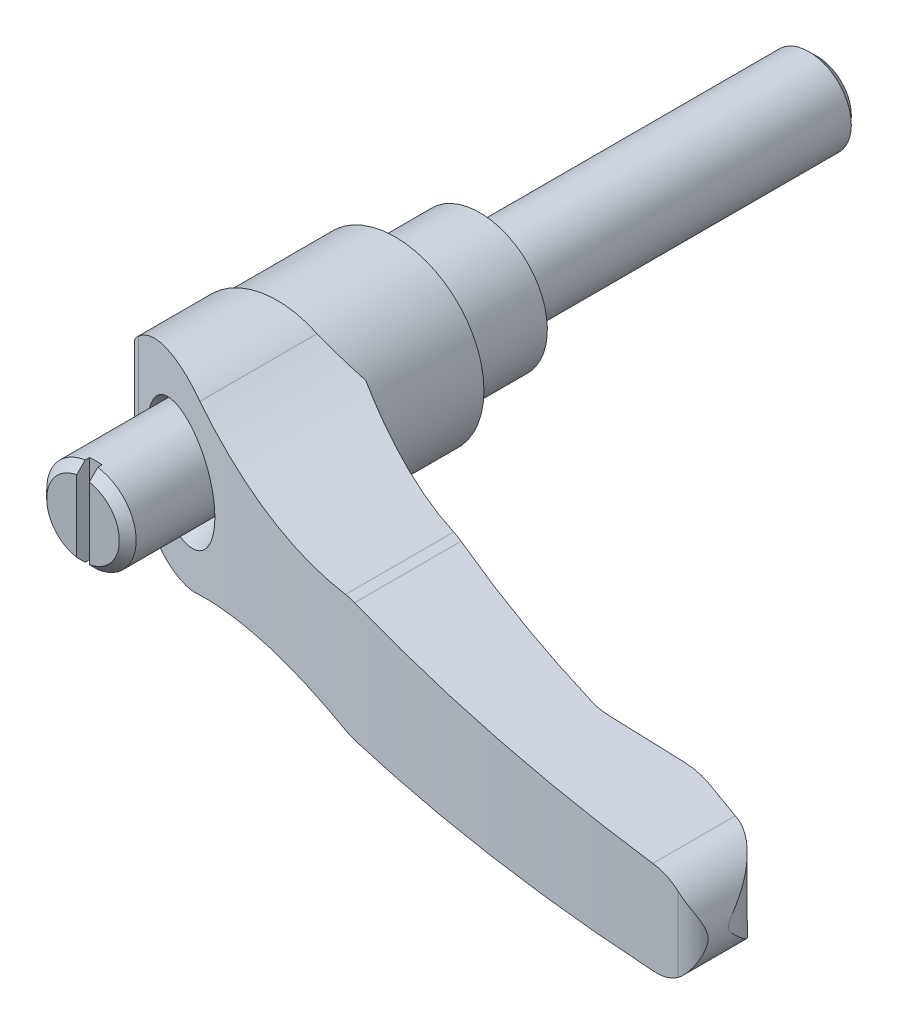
ISO-10303-21;
HEADER;
FILE_DESCRIPTION(('STEP AP214'),'2;1');
FILE_NAME('part.step','',(''),(''),'','','');
FILE_SCHEMA(('AUTOMOTIVE_DESIGN { 1 0 10303 214 1 1 1 1 }'));
ENDSEC;
DATA;
#1=APPLICATION_CONTEXT('core data for automotive mechanical design processes');
#2=APPLICATION_PROTOCOL_DEFINITION('international standard','automotive_design',2000,#1);
#3=PRODUCT_CONTEXT('',#1,'mechanical');
#4=PRODUCT('Part','Part','',(#3));
#5=PRODUCT_RELATED_PRODUCT_CATEGORY('part','',(#4));
#6=PRODUCT_DEFINITION_FORMATION('','',#4);
#7=PRODUCT_DEFINITION_CONTEXT('part definition',#1,'design');
#8=PRODUCT_DEFINITION('design','',#6,#7);
#9=PRODUCT_DEFINITION_SHAPE('','',#8);
#10=(LENGTH_UNIT() NAMED_UNIT(*) SI_UNIT(.MILLI.,.METRE.));
#11=(NAMED_UNIT(*) PLANE_ANGLE_UNIT() SI_UNIT($,.RADIAN.));
#12=(NAMED_UNIT(*) SI_UNIT($,.STERADIAN.) SOLID_ANGLE_UNIT());
#13=UNCERTAINTY_MEASURE_WITH_UNIT(LENGTH_MEASURE(1.E-05),#10,'distance_accuracy_value','');
#14=(GEOMETRIC_REPRESENTATION_CONTEXT(3) GLOBAL_UNCERTAINTY_ASSIGNED_CONTEXT((#13)) GLOBAL_UNIT_ASSIGNED_CONTEXT((#10,
#11,#12)) REPRESENTATION_CONTEXT('',''));
#15=CARTESIAN_POINT('',(0.,0.,0.));
#16=DIRECTION('',(0.,0.,1.));
#17=DIRECTION('',(1.,0.,0.));
#18=AXIS2_PLACEMENT_3D('',#15,#16,#17);
#19=CARTESIAN_POINT('',(-0.010000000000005,0.,27.8125));
#20=DIRECTION('',(0.,0.,-1.));
#21=DIRECTION('',(1.,0.,0.));
#22=AXIS2_PLACEMENT_3D('',#19,#20,#21);
#23=CYLINDRICAL_SURFACE('',#22,10.5);
#24=CARTESIAN_POINT('',(-0.0100000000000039,0.,24.));
#25=DIRECTION('',(0.,0.,1.));
#26=DIRECTION('',(0.,-1.,0.));
#27=AXIS2_PLACEMENT_3D('',#24,#25,#26);
#28=CIRCLE('',#27,10.5);
#29=CARTESIAN_POINT('',(-10.51,0.,24.));
#30=VERTEX_POINT('',#29);
#31=CARTESIAN_POINT('',(10.49,0.,24.));
#32=VERTEX_POINT('',#31);
#33=EDGE_CURVE('E221',#30,#32,#28,.T.);
#34=ORIENTED_EDGE('',*,*,#33,.F.);
#35=EDGE_CURVE('E220',#32,#30,#28,.T.);
#36=ORIENTED_EDGE('',*,*,#35,.F.);
#37=EDGE_LOOP('',(#34,#36));
#38=FACE_BOUND('',#37,.T.);
#39=CARTESIAN_POINT('',(-0.00999999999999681,0.,-0.250037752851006));
#40=DIRECTION('',(0.707106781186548,0.,0.707106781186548));
#41=DIRECTION('',(0.707106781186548,0.,-0.707106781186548));
#42=AXIS2_PLACEMENT_3D('',#39,#40,#41);
#43=ELLIPSE('',#42,14.8492424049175,10.5);
#44=CARTESIAN_POINT('',(-10.260037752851,-2.27743848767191,10.));
#45=VERTEX_POINT('',#44);
#46=CARTESIAN_POINT('',(-10.260037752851,2.27743848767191,10.));
#47=VERTEX_POINT('',#46);
#48=EDGE_CURVE('E475',#45,#47,#43,.F.);
#49=ORIENTED_EDGE('',*,*,#48,.F.);
#50=CARTESIAN_POINT('',(-0.0099999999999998,0.,10.));
#51=DIRECTION('',(0.,0.,-1.));
#52=DIRECTION('',(1.,0.,0.));
#53=AXIS2_PLACEMENT_3D('',#50,#51,#52);
#54=CIRCLE('',#53,10.5);
#55=EDGE_CURVE('E32',#47,#45,#54,.T.);
#56=ORIENTED_EDGE('',*,*,#55,.F.);
#57=EDGE_LOOP('',(#49,#56));
#58=FACE_BOUND('',#57,.T.);
#59=ADVANCED_FACE('F14',(#38,#58),#23,.T.);
#60=CARTESIAN_POINT('',(-10.51,-22.,10.249962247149));
#61=DIRECTION('',(0.707106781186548,0.,0.707106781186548));
#62=DIRECTION('',(-0.707106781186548,0.,0.707106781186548));
#63=AXIS2_PLACEMENT_3D('',#60,#61,#62);
#64=PLANE('',#63);
#65=ORIENTED_EDGE('',*,*,#48,.T.);
#66=DIRECTION('',(0.,1.,0.));
#67=VECTOR('',#66,1.);
#68=CARTESIAN_POINT('',(-10.260037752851,-22.,10.));
#69=LINE('',#68,#67);
#70=EDGE_CURVE('E85',#45,#47,#69,.T.);
#71=ORIENTED_EDGE('',*,*,#70,.F.);
#72=EDGE_LOOP('',(#65,#71));
#73=FACE_BOUND('',#72,.T.);
#74=ADVANCED_FACE('F459',(#73),#64,.F.);
#75=CARTESIAN_POINT('',(-0.0099999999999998,0.,10.));
#76=DIRECTION('',(0.,0.,-1.));
#77=DIRECTION('',(1.,0.,0.));
#78=AXIS2_PLACEMENT_3D('',#75,#76,#77);
#79=PLANE('',#78);
#80=CARTESIAN_POINT('',(0.,0.,10.));
#81=DIRECTION('',(0.,0.,-1.));
#82=DIRECTION('',(1.,0.,0.));
#83=AXIS2_PLACEMENT_3D('',#80,#81,#82);
#84=CIRCLE('',#83,8.3);
#85=CARTESIAN_POINT('',(8.3,0.,10.));
#86=VERTEX_POINT('',#85);
#87=EDGE_CURVE('E24',#86,#86,#84,.T.);
#88=ORIENTED_EDGE('',*,*,#87,.F.);
#89=EDGE_LOOP('',(#88));
#90=FACE_BOUND('',#89,.T.);
#91=ORIENTED_EDGE('',*,*,#70,.T.);
#92=ORIENTED_EDGE('',*,*,#55,.T.);
#93=EDGE_LOOP('',(#91,#92));
#94=FACE_BOUND('',#93,.T.);
#95=ADVANCED_FACE('F460',(#90,#94),#79,.T.);
#96=CARTESIAN_POINT('',(0.,0.,10.));
#97=DIRECTION('',(0.,0.,1.));
#98=DIRECTION('',(0.,-1.,0.));
#99=AXIS2_PLACEMENT_3D('',#96,#97,#98);
#100=CYLINDRICAL_SURFACE('',#99,8.3);
#101=ORIENTED_EDGE('',*,*,#87,.T.);
#102=EDGE_LOOP('',(#101));
#103=FACE_BOUND('',#102,.T.);
#104=CARTESIAN_POINT('',(0.,0.,10.4));
#105=DIRECTION('',(0.,0.,1.));
#106=DIRECTION('',(0.,-1.,0.));
#107=AXIS2_PLACEMENT_3D('',#104,#105,#106);
#108=CIRCLE('',#107,8.3);
#109=CARTESIAN_POINT('',(0.,-8.3,10.4));
#110=VERTEX_POINT('',#109);
#111=EDGE_CURVE('E1107',#110,#110,#108,.T.);
#112=ORIENTED_EDGE('',*,*,#111,.T.);
#113=EDGE_LOOP('',(#112));
#114=FACE_BOUND('',#113,.T.);
#115=ADVANCED_FACE('F462',(#103,#114),#100,.F.);
#116=CARTESIAN_POINT('',(0.,0.,10.7));
#117=DIRECTION('',(0.,0.,-1.));
#118=DIRECTION('',(0.,1.,0.));
#119=AXIS2_PLACEMENT_3D('',#116,#117,#118);
#120=CONICAL_SURFACE('',#119,8.,0.785398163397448);
#121=ORIENTED_EDGE('',*,*,#111,.F.);
#122=EDGE_LOOP('',(#121));
#123=FACE_BOUND('',#122,.T.);
#124=CARTESIAN_POINT('',(0.,0.,10.7));
#125=DIRECTION('',(0.,0.,1.));
#126=DIRECTION('',(0.,-1.,0.));
#127=AXIS2_PLACEMENT_3D('',#124,#125,#126);
#128=CIRCLE('',#127,8.);
#129=CARTESIAN_POINT('',(0.,-8.,10.7));
#130=VERTEX_POINT('',#129);
#131=EDGE_CURVE('E481',#130,#130,#128,.T.);
#132=ORIENTED_EDGE('',*,*,#131,.T.);
#133=EDGE_LOOP('',(#132));
#134=FACE_BOUND('',#133,.T.);
#135=ADVANCED_FACE('F413',(#123,#134),#120,.F.);
#136=CARTESIAN_POINT('',(57.3760512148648,-12.,33.4699999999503));
#137=DIRECTION('',(0.,1.,0.));
#138=DIRECTION('',(-1.,0.,0.));
#139=AXIS2_PLACEMENT_3D('',#136,#137,#138);
#140=CYLINDRICAL_SURFACE('',#139,8.59000000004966);
#141=CARTESIAN_POINT('',(57.3760512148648,6.11892873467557,33.4699999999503));
#142=DIRECTION('',(0.0361204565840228,0.999347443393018,0.));
#143=DIRECTION('',(-0.999347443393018,0.0361204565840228,0.));
#144=AXIS2_PLACEMENT_3D('',#141,#142,#143);
#145=ELLIPSE('',#144,8.59560912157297,8.59000000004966);
#146=CARTESIAN_POINT('',(57.37605121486,6.11892873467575,42.06));
#147=VERTEX_POINT('',#146);
#148=CARTESIAN_POINT('',(55.1138126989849,6.20069518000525,41.7567591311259));
#149=VERTEX_POINT('',#148);
#150=EDGE_CURVE('E569',#147,#149,#145,.F.);
#151=ORIENTED_EDGE('',*,*,#150,.F.);
#152=DIRECTION('',(0.,1.,0.));
#153=VECTOR('',#152,1.);
#154=CARTESIAN_POINT('',(57.37605121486,-12.,42.06));
#155=LINE('',#154,#153);
#156=CARTESIAN_POINT('',(57.37605121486,-6.11892873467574,42.06));
#157=VERTEX_POINT('',#156);
#158=EDGE_CURVE('E237',#157,#147,#155,.T.);
#159=ORIENTED_EDGE('',*,*,#158,.F.);
#160=CARTESIAN_POINT('',(57.3760512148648,-6.11892873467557,33.4699999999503));
#161=DIRECTION('',(0.0361204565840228,-0.999347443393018,0.));
#162=DIRECTION('',(0.999347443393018,0.0361204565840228,0.));
#163=AXIS2_PLACEMENT_3D('',#160,#161,#162);
#164=ELLIPSE('',#163,8.59560912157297,8.59000000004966);
#165=CARTESIAN_POINT('',(55.1138126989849,-6.20069518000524,41.7567591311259));
#166=VERTEX_POINT('',#165);
#167=EDGE_CURVE('E567',#166,#157,#164,.F.);
#168=ORIENTED_EDGE('',*,*,#167,.F.);
#169=DIRECTION('',(0.,1.,0.));
#170=VECTOR('',#169,1.);
#171=CARTESIAN_POINT('',(55.1138126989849,-12.,41.7567591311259));
#172=LINE('',#171,#170);
#173=EDGE_CURVE('E235',#166,#149,#172,.T.);
#174=ORIENTED_EDGE('',*,*,#173,.T.);
#175=EDGE_LOOP('',(#151,#159,#168,#174));
#176=FACE_BOUND('',#175,.T.);
#177=ADVANCED_FACE('F409',(#176),#140,.F.);
#178=CARTESIAN_POINT('',(57.37605121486,-12.,42.06));
#179=DIRECTION('',(0.,0.,1.));
#180=DIRECTION('',(0.,-1.,0.));
#181=AXIS2_PLACEMENT_3D('',#178,#179,#180);
#182=PLANE('',#181);
#183=DIRECTION('',(-0.999347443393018,0.0361204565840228,0.));
#184=VECTOR('',#183,1.);
#185=CARTESIAN_POINT('',(58.0300881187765,6.09528919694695,42.06));
#186=LINE('',#185,#184);
#187=CARTESIAN_POINT('',(66.163324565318,5.80132115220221,42.06));
#188=VERTEX_POINT('',#187);
#189=EDGE_CURVE('E563',#188,#147,#186,.T.);
#190=ORIENTED_EDGE('',*,*,#189,.F.);
#191=DIRECTION('',(0.,1.,0.));
#192=VECTOR('',#191,1.);
#193=CARTESIAN_POINT('',(66.163324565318,-12.,42.06));
#194=LINE('',#193,#192);
#195=CARTESIAN_POINT('',(66.163324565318,-5.80132115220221,42.06));
#196=VERTEX_POINT('',#195);
#197=EDGE_CURVE('E556',#196,#188,#194,.T.);
#198=ORIENTED_EDGE('',*,*,#197,.F.);
#199=DIRECTION('',(0.999347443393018,0.0361204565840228,0.));
#200=VECTOR('',#199,1.);
#201=CARTESIAN_POINT('',(57.1637628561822,-6.12660169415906,42.06));
#202=LINE('',#201,#200);
#203=EDGE_CURVE('E564',#157,#196,#202,.T.);
#204=ORIENTED_EDGE('',*,*,#203,.F.);
#205=ORIENTED_EDGE('',*,*,#158,.T.);
#206=EDGE_LOOP('',(#190,#198,#204,#205));
#207=FACE_BOUND('',#206,.T.);
#208=ADVANCED_FACE('F405',(#207),#182,.F.);
#209=CARTESIAN_POINT('',(66.1633245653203,-12.,53.3399999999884));
#210=DIRECTION('',(0.,1.,0.));
#211=DIRECTION('',(-1.,0.,0.));
#212=AXIS2_PLACEMENT_3D('',#209,#210,#211);
#213=CYLINDRICAL_SURFACE('',#212,11.2799999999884);
#214=CARTESIAN_POINT('',(66.1633245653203,5.80132115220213,53.3399999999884));
#215=DIRECTION('',(0.0361204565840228,0.999347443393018,0.));
#216=DIRECTION('',(-0.999347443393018,0.0361204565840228,0.));
#217=AXIS2_PLACEMENT_3D('',#214,#215,#216);
#218=ELLIPSE('',#217,11.2873656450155,11.2799999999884);
#219=CARTESIAN_POINT('',(69.761185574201,5.6712799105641,42.649172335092));
#220=VERTEX_POINT('',#219);
#221=EDGE_CURVE('E570',#220,#188,#218,.T.);
#222=ORIENTED_EDGE('',*,*,#221,.F.);
#223=DIRECTION('',(0.,1.,0.));
#224=VECTOR('',#223,1.);
#225=CARTESIAN_POINT('',(69.761185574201,-12.,42.649172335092));
#226=LINE('',#225,#224);
#227=CARTESIAN_POINT('',(69.761185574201,-5.6712799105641,42.649172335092));
#228=VERTEX_POINT('',#227);
#229=EDGE_CURVE('E553',#228,#220,#226,.T.);
#230=ORIENTED_EDGE('',*,*,#229,.F.);
#231=CARTESIAN_POINT('',(66.1633245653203,-5.80132115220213,53.3399999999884));
#232=DIRECTION('',(0.0361204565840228,-0.999347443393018,0.));
#233=DIRECTION('',(0.999347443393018,0.0361204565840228,0.));
#234=AXIS2_PLACEMENT_3D('',#231,#232,#233);
#235=ELLIPSE('',#234,11.2873656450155,11.2799999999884);
#236=EDGE_CURVE('E590',#196,#228,#235,.T.);
#237=ORIENTED_EDGE('',*,*,#236,.F.);
#238=ORIENTED_EDGE('',*,*,#197,.T.);
#239=EDGE_LOOP('',(#222,#230,#237,#238));
#240=FACE_BOUND('',#239,.T.);
#241=ADVANCED_FACE('F402',(#240),#213,.T.);
#242=CARTESIAN_POINT('',(111.590768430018,-12.,-165.122809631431));
#243=DIRECTION('',(0.,1.,0.));
#244=DIRECTION('',(-1.,0.,0.));
#245=AXIS2_PLACEMENT_3D('',#242,#243,#244);
#246=CYLINDRICAL_SURFACE('',#245,214.450000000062);
#247=CARTESIAN_POINT('',(30.179428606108,-6.9666323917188,33.2732494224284));
#248=CARTESIAN_POINT('',(30.4222007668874,-7.0028281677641,33.3728739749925));
#249=CARTESIAN_POINT('',(30.6665043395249,-7.02781937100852,33.472598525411));
#250=CARTESIAN_POINT('',(31.033921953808,-7.04840105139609,33.6217860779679));
#251=CARTESIAN_POINT('',(31.1565128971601,-7.05244559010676,33.6714318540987));
#252=CARTESIAN_POINT('',(31.4020580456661,-7.05489552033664,33.7706062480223));
#253=CARTESIAN_POINT('',(31.5250125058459,-7.05329063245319,33.820134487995));
#254=CARTESIAN_POINT('',(31.647932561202,-7.0488469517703,33.8695155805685));
#255=B_SPLINE_CURVE_WITH_KNOTS('',3,(#247,#248,#249,#250,#251,#252,#253,#254),.UNSPECIFIED.,.F.,
.F.,(4,2,2,4),(0.,0.794258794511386,1.19111760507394,1.58869889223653),.UNSPECIFIED.);
#256=CARTESIAN_POINT('',(30.179428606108,-6.9666323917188,33.2732494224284));
#257=VERTEX_POINT('',#256);
#258=CARTESIAN_POINT('',(31.647932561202,-7.0488469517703,33.8695155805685));
#259=VERTEX_POINT('',#258);
#260=EDGE_CURVE('E431',#257,#259,#255,.T.);
#261=ORIENTED_EDGE('',*,*,#260,.F.);
#262=CARTESIAN_POINT('',(10.49,-8.03465812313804,24.));
#263=CARTESIAN_POINT('',(11.2781269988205,-7.82806345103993,24.4213315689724));
#264=CARTESIAN_POINT('',(12.0728488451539,-7.64070973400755,24.8398212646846));
#265=CARTESIAN_POINT('',(13.6740672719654,-7.30530099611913,25.6700985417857));
#266=CARTESIAN_POINT('',(14.4805646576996,-7.15724867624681,26.0818856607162));
#267=CARTESIAN_POINT('',(16.0966341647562,-6.90241973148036,26.8940746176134));
#268=CARTESIAN_POINT('',(16.906116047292,-6.79528972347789,27.2945449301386));
#269=CARTESIAN_POINT('',(18.5335723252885,-6.62127786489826,28.0868684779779));
#270=CARTESIAN_POINT('',(19.3515465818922,-6.55439535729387,28.4787218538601));
#271=CARTESIAN_POINT('',(20.9944633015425,-6.46166065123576,29.2529521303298));
#272=CARTESIAN_POINT('',(21.8194069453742,-6.43581555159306,29.6353273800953));
#273=CARTESIAN_POINT('',(23.474294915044,-6.42593469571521,30.3896366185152));
#274=CARTESIAN_POINT('',(24.3042391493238,-6.44189817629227,30.7615707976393));
#275=CARTESIAN_POINT('',(25.974600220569,-6.51667337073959,31.497417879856));
#276=CARTESIAN_POINT('',(26.8150445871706,-6.57586454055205,31.8612301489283));
#277=CARTESIAN_POINT('',(28.4970001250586,-6.7381558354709,32.5766232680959));
#278=CARTESIAN_POINT('',(29.3385114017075,-6.84126069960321,32.9282027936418));
#279=CARTESIAN_POINT('',(30.179428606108,-6.96663239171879,33.2732494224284));
#280=B_SPLINE_CURVE_WITH_KNOTS('',3,(#262,#263,#264,#265,#266,#267,#268,#269,#270,#271,#272,
#273,#274,#275,#276,#277,#278,#279),.UNSPECIFIED.,.F.,.F.,(4,2,2,2,2,2,2,2,4),(0.,
2.7515590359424,5.50330712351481,8.23072437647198,10.9580971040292,13.6859415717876,
16.4137362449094,19.1657679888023,21.9180967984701),.UNSPECIFIED.);
#281=CARTESIAN_POINT('',(10.49,-8.03465812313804,24.));
#282=VERTEX_POINT('',#281);
#283=EDGE_CURVE('E211',#282,#257,#280,.T.);
#284=ORIENTED_EDGE('',*,*,#283,.F.);
#285=DIRECTION('',(0.,1.,0.));
#286=VECTOR('',#285,1.);
#287=CARTESIAN_POINT('',(10.49,-12.,24.));
#288=LINE('',#287,#286);
#289=EDGE_CURVE('E204',#282,#32,#288,.T.);
#290=ORIENTED_EDGE('',*,*,#289,.T.);
#291=CARTESIAN_POINT('',(10.49,8.03465812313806,24.));
#292=VERTEX_POINT('',#291);
#293=EDGE_CURVE('E210',#32,#292,#288,.T.);
#294=ORIENTED_EDGE('',*,*,#293,.T.);
#295=CARTESIAN_POINT('',(30.179428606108,6.9666323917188,33.2732494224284));
#296=CARTESIAN_POINT('',(29.3385114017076,6.84126069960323,32.9282027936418));
#297=CARTESIAN_POINT('',(28.4970001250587,6.73815583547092,32.5766232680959));
#298=CARTESIAN_POINT('',(26.8150445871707,6.57586454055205,31.8612301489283));
#299=CARTESIAN_POINT('',(25.974600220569,6.51667337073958,31.497417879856));
#300=CARTESIAN_POINT('',(24.3042391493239,6.44189817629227,30.7615707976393));
#301=CARTESIAN_POINT('',(23.4742949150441,6.42593469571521,30.3896366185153));
#302=CARTESIAN_POINT('',(21.8194069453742,6.43581555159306,29.6353273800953));
#303=CARTESIAN_POINT('',(20.9944633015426,6.46166065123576,29.2529521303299));
#304=CARTESIAN_POINT('',(19.3515465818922,6.55439535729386,28.4787218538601));
#305=CARTESIAN_POINT('',(18.5335723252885,6.62127786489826,28.0868684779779));
#306=CARTESIAN_POINT('',(16.906116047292,6.79528972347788,27.2945449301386));
#307=CARTESIAN_POINT('',(16.0966341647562,6.90241973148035,26.8940746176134));
#308=CARTESIAN_POINT('',(14.4805646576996,7.15724867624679,26.0818856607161));
#309=CARTESIAN_POINT('',(13.6740672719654,7.30530099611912,25.6700985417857));
#310=CARTESIAN_POINT('',(12.0728488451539,7.64070973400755,24.8398212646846));
#311=CARTESIAN_POINT('',(11.2781269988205,7.82806345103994,24.4213315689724));
#312=CARTESIAN_POINT('',(10.49,8.03465812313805,24.));
#313=B_SPLINE_CURVE_WITH_KNOTS('',3,(#295,#296,#297,#298,#299,#300,#301,#302,#303,#304,#305,
#306,#307,#308,#309,#310,#311,#312),.UNSPECIFIED.,.F.,.F.,(4,2,2,2,2,2,2,2,4),(0.,
2.75232880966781,5.50436055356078,8.23215522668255,10.9599996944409,13.6873724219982,
16.4147896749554,19.1665377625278,21.9180967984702),.UNSPECIFIED.);
#314=CARTESIAN_POINT('',(30.179428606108,6.9666323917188,33.2732494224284));
#315=VERTEX_POINT('',#314);
#316=EDGE_CURVE('E444',#315,#292,#313,.T.);
#317=ORIENTED_EDGE('',*,*,#316,.F.);
#318=CARTESIAN_POINT('',(31.647932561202,7.0488469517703,33.8695155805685));
#319=CARTESIAN_POINT('',(31.5250125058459,7.05329063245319,33.820134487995));
#320=CARTESIAN_POINT('',(31.4020580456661,7.05489552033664,33.7706062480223));
#321=CARTESIAN_POINT('',(31.1565128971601,7.05244559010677,33.6714318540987));
#322=CARTESIAN_POINT('',(31.033921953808,7.04840105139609,33.6217860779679));
#323=CARTESIAN_POINT('',(30.666504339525,7.02781937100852,33.472598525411));
#324=CARTESIAN_POINT('',(30.4222007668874,7.0028281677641,33.3728739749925));
#325=CARTESIAN_POINT('',(30.179428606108,6.9666323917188,33.2732494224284));
#326=B_SPLINE_CURVE_WITH_KNOTS('',3,(#318,#319,#320,#321,#322,#323,#324,#325),.UNSPECIFIED.,.F.,
.F.,(4,2,2,4),(0.,0.39758128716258,0.794440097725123,1.58869889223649),.UNSPECIFIED.);
#327=CARTESIAN_POINT('',(31.647932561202,7.0488469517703,33.8695155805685));
#328=VERTEX_POINT('',#327);
#329=EDGE_CURVE('E438',#328,#315,#326,.T.);
#330=ORIENTED_EDGE('',*,*,#329,.F.);
#331=CARTESIAN_POINT('',(111.590768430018,4.15938968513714,-165.122809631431));
#332=DIRECTION('',(0.0361204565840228,0.999347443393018,0.));
#333=DIRECTION('',(-0.999347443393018,0.0361204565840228,0.));
#334=AXIS2_PLACEMENT_3D('',#331,#332,#333);
#335=ELLIPSE('',#334,214.590032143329,214.450000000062);
#336=EDGE_CURVE('E445',#149,#328,#335,.F.);
#337=ORIENTED_EDGE('',*,*,#336,.F.);
#338=ORIENTED_EDGE('',*,*,#173,.F.);
#339=CARTESIAN_POINT('',(111.590768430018,-4.15938968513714,-165.122809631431));
#340=DIRECTION('',(0.0361204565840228,-0.999347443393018,0.));
#341=DIRECTION('',(0.999347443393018,0.0361204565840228,0.));
#342=AXIS2_PLACEMENT_3D('',#339,#340,#341);
#343=ELLIPSE('',#342,214.590032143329,214.450000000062);
#344=EDGE_CURVE('E595',#259,#166,#343,.F.);
#345=ORIENTED_EDGE('',*,*,#344,.F.);
#346=EDGE_LOOP('',(#261,#284,#290,#294,#317,#330,#337,#338,#345));
#347=FACE_BOUND('',#346,.T.);
#348=ADVANCED_FACE('F207',(#347),#246,.F.);
#349=CARTESIAN_POINT('',(79.996705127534,-12.,50.539592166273));
#350=DIRECTION('',(-0.99233193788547,0.,0.123601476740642));
#351=DIRECTION('',(-0.123601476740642,0.,-0.99233193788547));
#352=AXIS2_PLACEMENT_3D('',#349,#350,#351);
#353=PLANE('',#352);
#354=CARTESIAN_POINT('',(74.5,0.,6.40940703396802));
#355=DIRECTION('',(-0.99233193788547,0.,0.123601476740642));
#356=DIRECTION('',(0.123601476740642,0.,0.99233193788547));
#357=AXIS2_PLACEMENT_3D('',#354,#355,#356);
#358=ELLIPSE('',#357,44.4978502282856,5.5);
#359=CARTESIAN_POINT('',(79.996705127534,-0.190348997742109,50.539592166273));
#360=VERTEX_POINT('',#359);
#361=CARTESIAN_POINT('',(79.996705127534,0.190348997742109,50.539592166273));
#362=VERTEX_POINT('',#361);
#363=EDGE_CURVE('E385',#360,#362,#358,.T.);
#364=ORIENTED_EDGE('',*,*,#363,.F.);
#365=DIRECTION('',(0.,1.,0.));
#366=VECTOR('',#365,1.);
#367=CARTESIAN_POINT('',(79.996705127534,-12.,50.539592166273));
#368=LINE('',#367,#366);
#369=EDGE_CURVE('E547',#360,#362,#368,.T.);
#370=ORIENTED_EDGE('',*,*,#369,.T.);
#371=EDGE_LOOP('',(#364,#370));
#372=FACE_BOUND('',#371,.T.);
#373=ADVANCED_FACE('F396',(#372),#353,.F.);
#374=CARTESIAN_POINT('',(72.6137555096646,-12.,51.4591871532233));
#375=DIRECTION('',(0.,1.,0.));
#376=DIRECTION('',(-1.,0.,0.));
#377=AXIS2_PLACEMENT_3D('',#374,#375,#376);
#378=CYLINDRICAL_SURFACE('',#377,7.44000000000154);
#379=CARTESIAN_POINT('',(74.986812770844,-5.47841339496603,44.407790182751));
#380=CARTESIAN_POINT('',(75.1398120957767,-5.4648402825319,44.4592429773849));
#381=CARTESIAN_POINT('',(75.2905169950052,-5.44496899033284,44.5155387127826));
#382=CARTESIAN_POINT('',(75.5860882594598,-5.39377415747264,44.6368581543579));
#383=CARTESIAN_POINT('',(75.730963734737,-5.36246932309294,44.7018674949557));
#384=CARTESIAN_POINT('',(76.0125967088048,-5.2898955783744,44.839081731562));
#385=CARTESIAN_POINT('',(76.149425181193,-5.248738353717,44.9112009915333));
#386=CARTESIAN_POINT('',(76.4161065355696,-5.1573648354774,45.062373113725));
#387=CARTESIAN_POINT('',(76.5459558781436,-5.10714400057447,45.1414294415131));
#388=CARTESIAN_POINT('',(76.827653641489,-4.98604991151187,45.3247681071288));
#389=CARTESIAN_POINT('',(76.9775772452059,-4.91309116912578,45.4306358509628));
#390=CARTESIAN_POINT('',(77.2657899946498,-4.75681575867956,45.6501400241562));
#391=CARTESIAN_POINT('',(77.4040776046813,-4.67349772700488,45.7637774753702));
#392=CARTESIAN_POINT('',(77.8028296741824,-4.40945601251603,46.1156758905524));
#393=CARTESIAN_POINT('',(78.0457801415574,-4.21527563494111,46.3639882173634));
#394=CARTESIAN_POINT('',(78.4176945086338,-3.86589184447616,46.7984433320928));
#395=CARTESIAN_POINT('',(78.558647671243,-3.71726415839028,46.9799982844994));
#396=CARTESIAN_POINT('',(78.8199419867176,-3.41009407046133,47.3496806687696));
#397=CARTESIAN_POINT('',(78.9402736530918,-3.25154715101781,47.5378110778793));
#398=CARTESIAN_POINT('',(79.1607378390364,-2.92676895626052,47.9181651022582));
#399=CARTESIAN_POINT('',(79.2609186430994,-2.76055725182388,48.1103776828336));
#400=CARTESIAN_POINT('',(79.4421677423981,-2.42115236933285,48.497428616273));
#401=CARTESIAN_POINT('',(79.5232445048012,-2.24796232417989,48.6922657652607));
#402=CARTESIAN_POINT('',(79.657896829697,-1.91676087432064,49.0578102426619));
#403=CARTESIAN_POINT('',(79.713648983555,-1.75958096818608,49.2284695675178));
#404=CARTESIAN_POINT('',(79.7869638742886,-1.51825146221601,49.4826945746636));
#405=CARTESIAN_POINT('',(79.8097141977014,-1.43673320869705,49.5672896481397));
#406=CARTESIAN_POINT('',(79.8517302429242,-1.27132927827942,49.7350141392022));
#407=CARTESIAN_POINT('',(79.8709966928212,-1.18744410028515,49.8181438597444));
#408=CARTESIAN_POINT('',(79.907186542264,-1.01046435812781,49.986973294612));
#409=CARTESIAN_POINT('',(79.9238666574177,-0.917129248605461,50.0724723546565));
#410=CARTESIAN_POINT('',(79.9529450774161,-0.724505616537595,50.2358460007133));
#411=CARTESIAN_POINT('',(79.9653823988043,-0.625281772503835,50.3137850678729));
#412=CARTESIAN_POINT('',(79.9802376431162,-0.46858024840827,50.4153149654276));
#413=CARTESIAN_POINT('',(79.9845030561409,-0.416215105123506,50.4460963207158));
#414=CARTESIAN_POINT('',(79.9917045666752,-0.306879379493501,50.4998809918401));
#415=CARTESIAN_POINT('',(79.9946243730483,-0.249861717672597,50.522788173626));
#416=CARTESIAN_POINT('',(79.996705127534,-0.190348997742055,50.539592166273));
#417=B_SPLINE_CURVE_WITH_KNOTS('',3,(#379,#380,#381,#382,#383,#384,#385,#386,#387,#388,#389,
#390,#391,#392,#393,#394,#395,#396,#397,#398,#399,#400,#401,#402,#403,#404,#405,#406,#407,#408,
#409,#410,#411,#412,#413,#414,#415,#416),.UNSPECIFIED.,.F.,.F.,(4,2,2,2,2,2,2,2,2,2,2,2,2,2,2,2,
2,2,4),(0.,0.485611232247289,0.970431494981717,1.44999646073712,1.92980238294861,
2.52141817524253,3.11311192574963,4.30183389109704,5.12208341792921,5.94270927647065,
6.76134473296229,7.57961667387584,8.29494630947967,8.65387747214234,9.01273353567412,
9.39561932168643,9.77488268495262,9.95698827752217,10.1412441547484),.UNSPECIFIED.);
#418=CARTESIAN_POINT('',(74.986812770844,-5.47841339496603,44.407790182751));
#419=VERTEX_POINT('',#418);
#420=EDGE_CURVE('E384',#419,#360,#417,.T.);
#421=ORIENTED_EDGE('',*,*,#420,.F.);
#422=DIRECTION('',(0.,1.,0.));
#423=VECTOR('',#422,1.);
#424=CARTESIAN_POINT('',(74.986812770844,-12.,44.407790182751));
#425=LINE('',#424,#423);
#426=CARTESIAN_POINT('',(74.986812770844,5.47841339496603,44.407790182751));
#427=VERTEX_POINT('',#426);
#428=EDGE_CURVE('E550',#419,#427,#425,.T.);
#429=ORIENTED_EDGE('',*,*,#428,.T.);
#430=CARTESIAN_POINT('',(79.996705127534,0.190348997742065,50.539592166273));
#431=CARTESIAN_POINT('',(79.9951469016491,0.235214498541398,50.5270575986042));
#432=CARTESIAN_POINT('',(79.9930953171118,0.278736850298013,50.5108629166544));
#433=CARTESIAN_POINT('',(79.9881648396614,0.363077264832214,50.47327081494));
#434=CARTESIAN_POINT('',(79.9852922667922,0.403913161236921,50.451913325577));
#435=CARTESIAN_POINT('',(79.9757020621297,0.522458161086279,50.3833482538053));
#436=CARTESIAN_POINT('',(79.9679715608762,0.597169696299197,50.3312876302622));
#437=CARTESIAN_POINT('',(79.950886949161,0.736456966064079,50.225155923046));
#438=CARTESIAN_POINT('',(79.9416856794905,0.801375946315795,50.1714851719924));
#439=CARTESIAN_POINT('',(79.9214540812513,0.928420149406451,50.0612288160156));
#440=CARTESIAN_POINT('',(79.9104232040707,0.990544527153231,50.0046423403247));
#441=CARTESIAN_POINT('',(79.8746515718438,1.17419942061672,49.832312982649));
#442=CARTESIAN_POINT('',(79.847248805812,1.29287988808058,49.7141099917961));
#443=CARTESIAN_POINT('',(79.7848398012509,1.52823594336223,49.4729704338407));
#444=CARTESIAN_POINT('',(79.749692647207,1.64482416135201,49.3499864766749));
#445=CARTESIAN_POINT('',(79.6721004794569,1.8745831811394,49.1033284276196));
#446=CARTESIAN_POINT('',(79.6296610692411,1.98775652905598,48.9796549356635));
#447=CARTESIAN_POINT('',(79.5033816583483,2.29352791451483,48.641550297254));
#448=CARTESIAN_POINT('',(79.4120558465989,2.48329449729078,48.4272966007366));
#449=CARTESIAN_POINT('',(79.2061355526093,2.85434488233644,48.0023120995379));
#450=CARTESIAN_POINT('',(79.0915236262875,3.03562219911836,47.791584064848));
#451=CARTESIAN_POINT('',(78.8390032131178,3.38665877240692,47.3777391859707));
#452=CARTESIAN_POINT('',(78.7012752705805,3.5564939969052,47.174577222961));
#453=CARTESIAN_POINT('',(78.4009143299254,3.88356808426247,46.7768350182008));
#454=CARTESIAN_POINT('',(78.2383021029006,4.04081728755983,46.5822477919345));
#455=CARTESIAN_POINT('',(77.9568022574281,4.28016983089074,46.2794503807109));
#456=CARTESIAN_POINT('',(77.8461272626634,4.36735584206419,46.1675710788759));
#457=CARTESIAN_POINT('',(77.615129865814,4.53501217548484,45.9487274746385));
#458=CARTESIAN_POINT('',(77.4948054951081,4.61548112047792,45.8417641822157));
#459=CARTESIAN_POINT('',(77.2447591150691,4.76840923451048,45.633916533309));
#460=CARTESIAN_POINT('',(77.1150589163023,4.84088606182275,45.5330190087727));
#461=CARTESIAN_POINT('',(76.846172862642,4.97676025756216,45.3380932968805));
#462=CARTESIAN_POINT('',(76.7069926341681,5.04016294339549,45.2440611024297));
#463=CARTESIAN_POINT('',(76.4438690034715,5.14664435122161,45.079244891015));
#464=CARTESIAN_POINT('',(76.3213555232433,5.19134589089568,45.0072256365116));
#465=CARTESIAN_POINT('',(76.0703754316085,5.27269544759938,44.8693561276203));
#466=CARTESIAN_POINT('',(75.9419112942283,5.30934677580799,44.803503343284));
#467=CARTESIAN_POINT('',(75.6784961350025,5.3739797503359,44.6781572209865));
#468=CARTESIAN_POINT('',(75.5435027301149,5.40189236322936,44.618716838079));
#469=CARTESIAN_POINT('',(75.268600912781,5.44782102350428,44.5073869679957));
#470=CARTESIAN_POINT('',(75.1286862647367,5.46582399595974,44.4555075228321));
#471=CARTESIAN_POINT('',(74.986812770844,5.47841339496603,44.407790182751));
#472=B_SPLINE_CURVE_WITH_KNOTS('',3,(#430,#431,#432,#433,#434,#435,#436,#437,#438,#439,#440,
#441,#442,#443,#444,#445,#446,#447,#448,#449,#450,#451,#452,#453,#454,#455,#456,#457,#458,#459,
#460,#461,#462,#463,#464,#465,#466,#467,#468,#469,#470,#471),.UNSPECIFIED.,.F.,.F.,(4,2,2,2,2,2,
2,2,2,2,2,2,2,2,2,2,2,2,2,2,4),(0.,0.139245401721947,0.277446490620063,0.550810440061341,
0.804906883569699,1.05907965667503,1.56794086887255,2.08696422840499,2.60559053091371,
3.50582150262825,4.4067293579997,5.30090298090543,6.19433426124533,6.73367946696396,
7.27313498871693,7.81137365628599,8.34929561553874,8.7958064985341,9.24213337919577,
9.69190199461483,10.1422626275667),.UNSPECIFIED.);
#473=EDGE_CURVE('E378',#362,#427,#472,.T.);
#474=ORIENTED_EDGE('',*,*,#473,.F.);
#475=ORIENTED_EDGE('',*,*,#369,.F.);
#476=EDGE_LOOP('',(#421,#429,#474,#475));
#477=FACE_BOUND('',#476,.T.);
#478=ADVANCED_FACE('F391',(#477),#378,.T.);
#479=CARTESIAN_POINT('',(69.761185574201,-12.,42.649172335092));
#480=DIRECTION('',(-0.318959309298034,0.,0.947768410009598));
#481=DIRECTION('',(-0.947768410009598,0.,-0.318959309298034));
#482=AXIS2_PLACEMENT_3D('',#479,#480,#481);
#483=PLANE('',#482);
#484=DIRECTION('',(-0.947212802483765,0.0342360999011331,-0.318772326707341));
#485=VECTOR('',#484,1.);
#486=CARTESIAN_POINT('',(70.3342452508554,5.65056721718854,42.8420282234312));
#487=LINE('',#486,#485);
#488=CARTESIAN_POINT('',(74.5,5.5,44.2439595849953));
#489=VERTEX_POINT('',#488);
#490=EDGE_CURVE('E574',#489,#220,#487,.T.);
#491=ORIENTED_EDGE('',*,*,#490,.F.);
#492=CARTESIAN_POINT('',(74.5,0.,44.2439595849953));
#493=DIRECTION('',(-0.318959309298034,0.,0.947768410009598));
#494=DIRECTION('',(0.947768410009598,0.,0.318959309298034));
#495=AXIS2_PLACEMENT_3D('',#492,#493,#494);
#496=ELLIPSE('',#495,5.80310542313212,5.5);
#497=EDGE_CURVE('E575',#427,#489,#496,.T.);
#498=ORIENTED_EDGE('',*,*,#497,.F.);
#499=ORIENTED_EDGE('',*,*,#428,.F.);
#500=CARTESIAN_POINT('',(74.5,-5.5,44.2439595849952));
#501=VERTEX_POINT('',#500);
#502=EDGE_CURVE('E576',#501,#419,#496,.T.);
#503=ORIENTED_EDGE('',*,*,#502,.F.);
#504=DIRECTION('',(0.947212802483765,0.0342360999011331,0.318772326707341));
#505=VECTOR('',#504,1.);
#506=CARTESIAN_POINT('',(69.5559523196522,-5.6786978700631,42.5801037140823));
#507=LINE('',#506,#505);
#508=EDGE_CURVE('E591',#228,#501,#507,.T.);
#509=ORIENTED_EDGE('',*,*,#508,.F.);
#510=ORIENTED_EDGE('',*,*,#229,.T.);
#511=EDGE_LOOP('',(#491,#498,#499,#503,#509,#510));
#512=FACE_BOUND('',#511,.T.);
#513=ADVANCED_FACE('F395',(#512),#483,.F.);
#514=CARTESIAN_POINT('',(-10.51,-12.,24.));
#515=DIRECTION('',(0.,0.,1.));
#516=DIRECTION('',(0.,-1.,0.));
#517=AXIS2_PLACEMENT_3D('',#514,#515,#516);
#518=PLANE('',#517);
#519=CARTESIAN_POINT('',(22.94,55.5300000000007,24.));
#520=DIRECTION('',(0.,0.,1.));
#521=DIRECTION('',(0.,-1.,0.));
#522=AXIS2_PLACEMENT_3D('',#519,#520,#521);
#523=CIRCLE('',#522,49.1000000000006);
#524=CARTESIAN_POINT('',(4.7225102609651,9.9346815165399,24.));
#525=VERTEX_POINT('',#524);
#526=EDGE_CURVE('E234',#292,#525,#523,.F.);
#527=ORIENTED_EDGE('',*,*,#526,.F.);
#528=ORIENTED_EDGE('',*,*,#293,.F.);
#529=ORIENTED_EDGE('',*,*,#35,.T.);
#530=DIRECTION('',(0.,1.,0.));
#531=VECTOR('',#530,1.);
#532=CARTESIAN_POINT('',(-10.51,-12.,24.));
#533=LINE('',#532,#531);
#534=CARTESIAN_POINT('',(-10.51,3.24652121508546,24.));
#535=VERTEX_POINT('',#534);
#536=EDGE_CURVE('E215',#30,#535,#533,.T.);
#537=ORIENTED_EDGE('',*,*,#536,.T.);
#538=CARTESIAN_POINT('',(0.,0.,24.));
#539=DIRECTION('',(0.,0.,1.));
#540=DIRECTION('',(0.,-1.,0.));
#541=AXIS2_PLACEMENT_3D('',#538,#539,#540);
#542=CIRCLE('',#541,11.);
#543=EDGE_CURVE('E1039',#525,#535,#542,.T.);
#544=ORIENTED_EDGE('',*,*,#543,.F.);
#545=EDGE_LOOP('',(#527,#528,#529,#537,#544));
#546=FACE_BOUND('',#545,.T.);
#547=ADVANCED_FACE('F232',(#546),#518,.F.);
#548=CARTESIAN_POINT('',(22.94,-55.5300000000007,24.));
#549=DIRECTION('',(0.,0.,1.));
#550=DIRECTION('',(0.,-1.,0.));
#551=AXIS2_PLACEMENT_3D('',#548,#549,#550);
#552=CIRCLE('',#551,49.1000000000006);
#553=CARTESIAN_POINT('',(4.7225102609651,-9.9346815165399,24.));
#554=VERTEX_POINT('',#553);
#555=EDGE_CURVE('E1037',#554,#282,#552,.F.);
#556=ORIENTED_EDGE('',*,*,#555,.F.);
#557=CARTESIAN_POINT('',(0.,0.,24.));
#558=DIRECTION('',(0.,0.,1.));
#559=DIRECTION('',(0.,-1.,0.));
#560=AXIS2_PLACEMENT_3D('',#557,#558,#559);
#561=CIRCLE('',#560,11.);
#562=CARTESIAN_POINT('',(-10.51,-3.24652121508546,24.));
#563=VERTEX_POINT('',#562);
#564=EDGE_CURVE('E538',#563,#554,#561,.T.);
#565=ORIENTED_EDGE('',*,*,#564,.F.);
#566=EDGE_CURVE('E230',#563,#30,#533,.T.);
#567=ORIENTED_EDGE('',*,*,#566,.T.);
#568=ORIENTED_EDGE('',*,*,#33,.T.);
#569=ORIENTED_EDGE('',*,*,#289,.F.);
#570=EDGE_LOOP('',(#556,#565,#567,#568,#569));
#571=FACE_BOUND('',#570,.T.);
#572=ADVANCED_FACE('F227',(#571),#518,.F.);
#573=CARTESIAN_POINT('',(77.9746679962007,-12.,52.1048483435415));
#574=DIRECTION('',(0.,1.,0.));
#575=DIRECTION('',(-1.,0.,0.));
#576=AXIS2_PLACEMENT_3D('',#573,#574,#575);
#577=CYLINDRICAL_SURFACE('',#576,2.20000000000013);
#578=CARTESIAN_POINT('',(77.798742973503,4.40094248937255,54.297803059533));
#579=CARTESIAN_POINT('',(77.873929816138,4.34461033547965,54.3038288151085));
#580=CARTESIAN_POINT('',(77.9477917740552,4.28621521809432,54.3058709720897));
#581=CARTESIAN_POINT('',(78.0922208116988,4.16589830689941,54.3028912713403));
#582=CARTESIAN_POINT('',(78.1627937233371,4.10398322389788,54.2978824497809));
#583=CARTESIAN_POINT('',(78.2996338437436,3.97761161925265,54.2817956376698));
#584=CARTESIAN_POINT('',(78.3659353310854,3.91318450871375,54.2707752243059));
#585=CARTESIAN_POINT('',(78.4947211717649,3.78162408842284,54.2435114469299));
#586=CARTESIAN_POINT('',(78.5572032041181,3.71448917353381,54.2272649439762));
#587=CARTESIAN_POINT('',(78.7037263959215,3.54901721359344,54.182483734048));
#588=CARTESIAN_POINT('',(78.7857223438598,3.44948168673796,54.1516573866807));
#589=CARTESIAN_POINT('',(78.9414411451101,3.24653335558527,54.0828783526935));
#590=CARTESIAN_POINT('',(79.0151615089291,3.14311939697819,54.0449235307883));
#591=CARTESIAN_POINT('',(79.2246832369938,2.82692774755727,53.9224540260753));
#592=CARTESIAN_POINT('',(79.3481089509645,2.609042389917,53.829588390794));
#593=CARTESIAN_POINT('',(79.5118173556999,2.26904106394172,53.6805956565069));
#594=CARTESIAN_POINT('',(79.5637254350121,2.15065893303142,53.6280001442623));
#595=CARTESIAN_POINT('',(79.6590195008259,1.91080459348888,53.5218995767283));
#596=CARTESIAN_POINT('',(79.7024022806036,1.789331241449,53.4683941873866));
#597=CARTESIAN_POINT('',(79.7806945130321,1.54303752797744,53.3628544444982));
#598=CARTESIAN_POINT('',(79.8156035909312,1.41821701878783,53.3108201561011));
#599=CARTESIAN_POINT('',(79.8768533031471,1.16468164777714,53.2116769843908));
#600=CARTESIAN_POINT('',(79.9031999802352,1.03596960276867,53.1645646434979));
#601=CARTESIAN_POINT('',(79.9502292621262,0.753846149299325,53.0744438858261));
#602=CARTESIAN_POINT('',(79.9694918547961,0.599603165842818,53.0330810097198));
#603=CARTESIAN_POINT('',(79.9884623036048,0.364537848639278,52.9907827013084));
#604=CARTESIAN_POINT('',(79.993132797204,0.285927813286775,52.9799792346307));
#605=CARTESIAN_POINT('',(79.9990802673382,0.12789817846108,52.9661347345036));
#606=CARTESIAN_POINT('',(80.0003586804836,0.048478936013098,52.9630904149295));
#607=CARTESIAN_POINT('',(79.9994656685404,-0.110643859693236,52.965194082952));
#608=CARTESIAN_POINT('',(79.9972760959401,-0.190346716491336,52.9703851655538));
#609=CARTESIAN_POINT('',(79.9895067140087,-0.348729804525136,52.9883178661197));
#610=CARTESIAN_POINT('',(79.983925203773,-0.427409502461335,53.0010632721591));
#611=CARTESIAN_POINT('',(79.9622241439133,-0.662630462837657,53.0486779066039));
#612=CARTESIAN_POINT('',(79.9411622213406,-0.816788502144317,53.0928557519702));
#613=CARTESIAN_POINT('',(79.8883952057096,-1.11212828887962,53.1914221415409));
#614=CARTESIAN_POINT('',(79.85716938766,-1.25358307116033,53.245309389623));
#615=CARTESIAN_POINT('',(79.7842829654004,-1.53200335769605,53.3577691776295));
#616=CARTESIAN_POINT('',(79.74261300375,-1.66896471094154,53.4163458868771));
#617=CARTESIAN_POINT('',(79.6489027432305,-1.93886019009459,53.5340438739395));
#618=CARTESIAN_POINT('',(79.5968732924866,-2.07179836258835,53.5931645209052));
#619=CARTESIAN_POINT('',(79.4822877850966,-2.33393789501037,53.709135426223));
#620=CARTESIAN_POINT('',(79.4197377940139,-2.46314135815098,53.7659869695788));
#621=CARTESIAN_POINT('',(79.2437827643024,-2.7926663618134,53.9072079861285));
#622=CARTESIAN_POINT('',(79.1220745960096,-2.99022899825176,53.988148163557));
#623=CARTESIAN_POINT('',(78.9187262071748,-3.27696925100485,54.093454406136));
#624=CARTESIAN_POINT('',(78.8476226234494,-3.37079169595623,54.1258294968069));
#625=CARTESIAN_POINT('',(78.6984500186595,-3.55485935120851,54.1839198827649));
#626=CARTESIAN_POINT('',(78.6203863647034,-3.64510724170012,54.209640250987));
#627=CARTESIAN_POINT('',(78.4833241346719,-3.79339526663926,54.2460114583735));
#628=CARTESIAN_POINT('',(78.4261294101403,-3.85257392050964,54.2588546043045));
#629=CARTESIAN_POINT('',(78.3087404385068,-3.96866565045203,54.2801534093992));
#630=CARTESIAN_POINT('',(78.2485476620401,-4.02557981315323,54.2886111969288));
#631=CARTESIAN_POINT('',(78.1248892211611,-4.13728909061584,54.300599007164));
#632=CARTESIAN_POINT('',(78.06140209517,-4.19206473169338,54.3040909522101));
#633=CARTESIAN_POINT('',(77.9318740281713,-4.29875909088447,54.3053863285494));
#634=CARTESIAN_POINT('',(77.865829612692,-4.35067367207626,54.3031817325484));
#635=CARTESIAN_POINT('',(77.798742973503,-4.40094248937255,54.297803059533));
#636=B_SPLINE_CURVE_WITH_KNOTS('',3,(#578,#579,#580,#581,#582,#583,#584,#585,#586,#587,#588,
#589,#590,#591,#592,#593,#594,#595,#596,#597,#598,#599,#600,#601,#602,#603,#604,#605,#606,#607,
#608,#609,#610,#611,#612,#613,#614,#615,#616,#617,#618,#619,#620,#621,#622,#623,#624,#625,#626,
#627,#628,#629,#630,#631,#632,#633,#634,#635),.UNSPECIFIED.,.F.,.F.,(4,2,2,2,2,2,2,2,2,2,2,2,2,
2,2,2,2,2,2,2,2,2,2,2,2,2,2,2,4),(0.,0.282196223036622,0.563871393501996,0.84289495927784,
1.12208642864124,1.51924084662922,1.91651441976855,2.71446317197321,3.13292824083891,
3.55155041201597,3.97019109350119,4.38853568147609,4.86893910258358,5.10700790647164,
5.34497586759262,5.58419320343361,5.82353059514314,6.30682886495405,6.77001918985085,
7.23362600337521,7.69674987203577,8.15960763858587,8.89408077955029,9.26002910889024,
9.62569764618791,9.87541390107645,10.1250088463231,10.3765075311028,10.6283608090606),.UNSPECIFIED.);
#637=CARTESIAN_POINT('',(77.798742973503,4.40094248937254,54.297803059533));
#638=VERTEX_POINT('',#637);
#639=CARTESIAN_POINT('',(77.798742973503,-4.40094248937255,54.297803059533));
#640=VERTEX_POINT('',#639);
#641=EDGE_CURVE('E370',#638,#640,#636,.T.);
#642=ORIENTED_EDGE('',*,*,#641,.F.);
#643=DIRECTION('',(0.,1.,0.));
#644=VECTOR('',#643,1.);
#645=CARTESIAN_POINT('',(77.798742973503,-12.,54.297803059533));
#646=LINE('',#645,#644);
#647=EDGE_CURVE('E542',#640,#638,#646,.T.);
#648=ORIENTED_EDGE('',*,*,#647,.F.);
#649=EDGE_LOOP('',(#642,#648));
#650=FACE_BOUND('',#649,.T.);
#651=ADVANCED_FACE('F297',(#650),#577,.T.);
#652=CARTESIAN_POINT('',(31.647932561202,-7.0488469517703,0.));
#653=DIRECTION('',(0.0361204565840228,-0.999347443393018,0.));
#654=DIRECTION('',(0.999347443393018,0.0361204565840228,0.));
#655=AXIS2_PLACEMENT_3D('',#652,#653,#654);
#656=PLANE('',#655);
#657=ORIENTED_EDGE('',*,*,#344,.T.);
#658=ORIENTED_EDGE('',*,*,#167,.T.);
#659=ORIENTED_EDGE('',*,*,#203,.T.);
#660=ORIENTED_EDGE('',*,*,#236,.T.);
#661=ORIENTED_EDGE('',*,*,#508,.T.);
#662=DIRECTION('',(0.,0.,1.));
#663=VECTOR('',#662,1.);
#664=CARTESIAN_POINT('',(74.5,-5.5,0.));
#665=LINE('',#664,#663);
#666=CARTESIAN_POINT('',(74.5,-5.5,54.0125431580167));
#667=VERTEX_POINT('',#666);
#668=EDGE_CURVE('E496',#501,#667,#665,.T.);
#669=ORIENTED_EDGE('',*,*,#668,.T.);
#670=CARTESIAN_POINT('',(99.1192564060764,-4.61016054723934,-211.468372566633));
#671=DIRECTION('',(0.0361204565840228,-0.999347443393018,0.));
#672=DIRECTION('',(0.999347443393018,0.0361204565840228,0.));
#673=AXIS2_PLACEMENT_3D('',#670,#671,#672);
#674=ELLIPSE('',#673,266.794098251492,266.619999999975);
#675=CARTESIAN_POINT('',(31.647932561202,-7.0488469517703,46.4731806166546));
#676=VERTEX_POINT('',#675);
#677=EDGE_CURVE('E516',#667,#676,#674,.T.);
#678=ORIENTED_EDGE('',*,*,#677,.T.);
#679=DIRECTION('',(0.,0.,1.));
#680=VECTOR('',#679,1.);
#681=CARTESIAN_POINT('',(31.647932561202,-7.0488469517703,0.));
#682=LINE('',#681,#680);
#683=EDGE_CURVE('E493',#259,#676,#682,.T.);
#684=ORIENTED_EDGE('',*,*,#683,.F.);
#685=EDGE_LOOP('',(#657,#658,#659,#660,#661,#669,#678,#684));
#686=FACE_BOUND('',#685,.T.);
#687=ADVANCED_FACE('F363',(#686),#656,.T.);
#688=CARTESIAN_POINT('',(31.3589689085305,0.94593259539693,0.));
#689=DIRECTION('',(0.,0.,1.));
#690=DIRECTION('',(0.,-1.,0.));
#691=AXIS2_PLACEMENT_3D('',#688,#689,#690);
#692=CYLINDRICAL_SURFACE('',#691,8.00000000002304);
#693=ORIENTED_EDGE('',*,*,#260,.T.);
#694=ORIENTED_EDGE('',*,*,#683,.T.);
#695=CARTESIAN_POINT('',(31.647932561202,-7.0488469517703,46.4731806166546));
#696=CARTESIAN_POINT('',(31.4018180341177,-7.05768532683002,46.408799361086));
#697=CARTESIAN_POINT('',(31.1563854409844,-7.05525330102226,46.344225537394));
#698=CARTESIAN_POINT('',(30.6668841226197,-7.02784844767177,46.2146927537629));
#699=CARTESIAN_POINT('',(30.4228153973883,-7.00287562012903,46.1497337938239));
#700=CARTESIAN_POINT('',(30.179428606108,-6.9666323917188,46.0845822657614));
#701=B_SPLINE_CURVE_WITH_KNOTS('',3,(#695,#696,#697,#698,#699,#700),.UNSPECIFIED.,.F.,.F.,(4,2,
4),(0.,0.761390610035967,1.52278122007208),.UNSPECIFIED.);
#702=CARTESIAN_POINT('',(30.179428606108,-6.9666323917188,46.0845822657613));
#703=VERTEX_POINT('',#702);
#704=EDGE_CURVE('E318',#676,#703,#701,.T.);
#705=ORIENTED_EDGE('',*,*,#704,.T.);
#706=DIRECTION('',(0.,0.,1.));
#707=VECTOR('',#706,1.);
#708=CARTESIAN_POINT('',(30.179428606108,-6.9666323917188,0.));
#709=LINE('',#708,#707);
#710=EDGE_CURVE('E490',#257,#703,#709,.T.);
#711=ORIENTED_EDGE('',*,*,#710,.F.);
#712=EDGE_LOOP('',(#693,#694,#705,#711));
#713=FACE_BOUND('',#712,.T.);
#714=ADVANCED_FACE('F606',(#713),#692,.T.);
#715=CARTESIAN_POINT('',(22.94,-55.5300000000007,0.));
#716=DIRECTION('',(0.,0.,1.));
#717=DIRECTION('',(0.,-1.,0.));
#718=AXIS2_PLACEMENT_3D('',#715,#716,#717);
#719=CYLINDRICAL_SURFACE('',#718,49.1000000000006);
#720=ORIENTED_EDGE('',*,*,#555,.T.);
#721=ORIENTED_EDGE('',*,*,#283,.T.);
#722=ORIENTED_EDGE('',*,*,#710,.T.);
#723=CARTESIAN_POINT('',(30.179428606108,-6.96663239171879,46.0845822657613));
#724=CARTESIAN_POINT('',(29.4553482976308,-6.85868252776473,45.8907746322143));
#725=CARTESIAN_POINT('',(28.729831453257,-6.76709208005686,45.6932930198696));
#726=CARTESIAN_POINT('',(27.2773814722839,-6.61650566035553,45.291312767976));
#727=CARTESIAN_POINT('',(26.550448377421,-6.5575087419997,45.0868143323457));
#728=CARTESIAN_POINT('',(25.0965601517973,-6.471977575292,44.6711142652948));
#729=CARTESIAN_POINT('',(24.3696050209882,-6.44544423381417,44.4599124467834));
#730=CARTESIAN_POINT('',(22.9171454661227,-6.42463238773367,44.0312093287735));
#731=CARTESIAN_POINT('',(22.1916410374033,-6.43035377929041,43.8137080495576));
#732=CARTESIAN_POINT('',(20.0493707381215,-6.49464247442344,43.1615010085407));
#733=CARTESIAN_POINT('',(18.6362884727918,-6.59858948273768,42.718348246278));
#734=CARTESIAN_POINT('',(15.8309607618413,-6.92685704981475,41.8130049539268));
#735=CARTESIAN_POINT('',(14.4387083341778,-7.15113630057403,41.3508210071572));
#736=CARTESIAN_POINT('',(12.351397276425,-7.57984707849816,40.6389991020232));
#737=CARTESIAN_POINT('',(11.6453595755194,-7.74124938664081,40.3948734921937));
#738=CARTESIAN_POINT('',(10.2423533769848,-8.09475068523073,39.9032102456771));
#739=CARTESIAN_POINT('',(9.54538288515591,-8.28684279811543,39.6556733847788));
#740=CARTESIAN_POINT('',(8.15397624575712,-8.70354710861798,39.1550395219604));
#741=CARTESIAN_POINT('',(7.45965103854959,-8.9284917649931,38.9019113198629));
#742=CARTESIAN_POINT('',(6.0822924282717,-9.40885674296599,38.3933645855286));
#743=CARTESIAN_POINT('',(5.39926142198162,-9.66428344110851,38.1379455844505));
#744=CARTESIAN_POINT('',(4.72251026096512,-9.93468151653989,37.8817401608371));
#745=B_SPLINE_CURVE_WITH_KNOTS('',3,(#723,#724,#725,#726,#727,#728,#729,#730,#731,#732,#733,
#734,#735,#736,#737,#738,#739,#740,#741,#742,#743,#744),.UNSPECIFIED.,.F.,.F.,(4,2,2,2,2,2,2,2,
2,2,4),(0.,2.27169105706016,4.54331615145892,6.81500470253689,9.08668594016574,13.5348660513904,
17.9815201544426,20.2738137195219,22.5655943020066,24.8824210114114,27.1997332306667),.UNSPECIFIED.);
#746=CARTESIAN_POINT('',(4.7225102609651,-9.9346815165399,37.8817401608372));
#747=VERTEX_POINT('',#746);
#748=EDGE_CURVE('E311',#703,#747,#745,.T.);
#749=ORIENTED_EDGE('',*,*,#748,.T.);
#750=DIRECTION('',(0.,0.,1.));
#751=VECTOR('',#750,1.);
#752=CARTESIAN_POINT('',(4.7225102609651,-9.9346815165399,0.));
#753=LINE('',#752,#751);
#754=EDGE_CURVE('E487',#554,#747,#753,.T.);
#755=ORIENTED_EDGE('',*,*,#754,.F.);
#756=EDGE_LOOP('',(#720,#721,#722,#749,#755));
#757=FACE_BOUND('',#756,.T.);
#758=ADVANCED_FACE('F272',(#757),#719,.F.);
#759=CARTESIAN_POINT('',(22.94,55.5300000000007,0.));
#760=DIRECTION('',(0.,0.,1.));
#761=DIRECTION('',(0.,-1.,0.));
#762=AXIS2_PLACEMENT_3D('',#759,#760,#761);
#763=CYLINDRICAL_SURFACE('',#762,49.1000000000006);
#764=ORIENTED_EDGE('',*,*,#526,.T.);
#765=DIRECTION('',(0.,0.,1.));
#766=VECTOR('',#765,1.);
#767=CARTESIAN_POINT('',(4.7225102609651,9.9346815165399,0.));
#768=LINE('',#767,#766);
#769=CARTESIAN_POINT('',(4.7225102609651,9.9346815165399,37.8817401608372));
#770=VERTEX_POINT('',#769);
#771=EDGE_CURVE('E478',#525,#770,#768,.T.);
#772=ORIENTED_EDGE('',*,*,#771,.T.);
#773=CARTESIAN_POINT('',(4.72251026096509,9.93468151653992,37.8817401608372));
#774=CARTESIAN_POINT('',(5.38601967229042,9.6695845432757,38.132928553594));
#775=CARTESIAN_POINT('',(6.05547912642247,9.4188950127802,38.3833346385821));
#776=CARTESIAN_POINT('',(7.40543727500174,8.94675230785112,38.8820168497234));
#777=CARTESIAN_POINT('',(8.0859363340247,8.72530010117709,39.1302929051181));
#778=CARTESIAN_POINT('',(10.1431096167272,8.10531360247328,39.8712239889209));
#779=CARTESIAN_POINT('',(11.5349994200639,7.75133354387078,40.3598072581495));
#780=CARTESIAN_POINT('',(14.3196466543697,7.17216929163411,41.3109198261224));
#781=CARTESIAN_POINT('',(15.7117617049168,6.94441673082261,41.7737817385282));
#782=CARTESIAN_POINT('',(18.5161183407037,6.60933679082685,42.6802593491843));
#783=CARTESIAN_POINT('',(19.9283492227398,6.50194762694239,43.1238848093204));
#784=CARTESIAN_POINT('',(22.0758785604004,6.43216342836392,43.7788145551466));
#785=CARTESIAN_POINT('',(22.8074388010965,6.4247152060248,43.9984832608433));
#786=CARTESIAN_POINT('',(24.2719625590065,6.44260972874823,44.4313921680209));
#787=CARTESIAN_POINT('',(25.0049257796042,6.46794617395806,44.6446335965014));
#788=CARTESIAN_POINT('',(26.4790301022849,6.55208369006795,45.0666464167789));
#789=CARTESIAN_POINT('',(27.2201718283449,6.61125245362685,45.275342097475));
#790=CARTESIAN_POINT('',(28.7011833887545,6.7634815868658,45.6854942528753));
#791=CARTESIAN_POINT('',(29.441052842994,6.85655075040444,45.8869488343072));
#792=CARTESIAN_POINT('',(30.179428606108,6.9666323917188,46.0845822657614));
#793=B_SPLINE_CURVE_WITH_KNOTS('',3,(#773,#774,#775,#776,#777,#778,#779,#780,#781,#782,#783,
#784,#785,#786,#787,#788,#789,#790,#791,#792),.UNSPECIFIED.,.F.,.F.,(4,2,2,2,2,2,2,2,2,4),(0.,
2.27178178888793,4.54363875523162,9.08892529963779,13.5379720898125,17.9847340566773,
20.2757253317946,22.5662764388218,24.8822079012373,27.1987405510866),.UNSPECIFIED.);
#794=CARTESIAN_POINT('',(30.179428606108,6.9666323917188,46.0845822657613));
#795=VERTEX_POINT('',#794);
#796=EDGE_CURVE('E334',#770,#795,#793,.T.);
#797=ORIENTED_EDGE('',*,*,#796,.T.);
#798=DIRECTION('',(0.,0.,1.));
#799=VECTOR('',#798,1.);
#800=CARTESIAN_POINT('',(30.179428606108,6.9666323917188,0.));
#801=LINE('',#800,#799);
#802=EDGE_CURVE('E288',#315,#795,#801,.T.);
#803=ORIENTED_EDGE('',*,*,#802,.F.);
#804=ORIENTED_EDGE('',*,*,#316,.T.);
#805=EDGE_LOOP('',(#764,#772,#797,#803,#804));
#806=FACE_BOUND('',#805,.T.);
#807=ADVANCED_FACE('F269',(#806),#763,.F.);
#808=CARTESIAN_POINT('',(31.3589689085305,-0.945932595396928,0.));
#809=DIRECTION('',(0.,0.,1.));
#810=DIRECTION('',(0.,-1.,0.));
#811=AXIS2_PLACEMENT_3D('',#808,#809,#810);
#812=CYLINDRICAL_SURFACE('',#811,8.00000000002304);
#813=ORIENTED_EDGE('',*,*,#329,.T.);
#814=ORIENTED_EDGE('',*,*,#802,.T.);
#815=CARTESIAN_POINT('',(30.179428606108,6.9666323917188,46.0845822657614));
#816=CARTESIAN_POINT('',(30.4228153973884,7.00287562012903,46.1497337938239));
#817=CARTESIAN_POINT('',(30.6668841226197,7.02784844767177,46.214692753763));
#818=CARTESIAN_POINT('',(31.1563854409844,7.05525330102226,46.344225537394));
#819=CARTESIAN_POINT('',(31.4018180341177,7.05768532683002,46.408799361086));
#820=CARTESIAN_POINT('',(31.647932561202,7.0488469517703,46.4731806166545));
#821=B_SPLINE_CURVE_WITH_KNOTS('',3,(#815,#816,#817,#818,#819,#820),.UNSPECIFIED.,.F.,.F.,(4,2,
4),(0.,0.76139061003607,1.522781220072),.UNSPECIFIED.);
#822=CARTESIAN_POINT('',(31.647932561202,7.0488469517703,46.4731806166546));
#823=VERTEX_POINT('',#822);
#824=EDGE_CURVE('E340',#795,#823,#821,.T.);
#825=ORIENTED_EDGE('',*,*,#824,.T.);
#826=DIRECTION('',(0.,0.,1.));
#827=VECTOR('',#826,1.);
#828=CARTESIAN_POINT('',(31.647932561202,7.0488469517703,0.));
#829=LINE('',#828,#827);
#830=EDGE_CURVE('E289',#328,#823,#829,.T.);
#831=ORIENTED_EDGE('',*,*,#830,.F.);
#832=EDGE_LOOP('',(#813,#814,#825,#831));
#833=FACE_BOUND('',#832,.T.);
#834=ADVANCED_FACE('F452',(#833),#812,.T.);
#835=CARTESIAN_POINT('',(74.5,5.5,0.));
#836=DIRECTION('',(0.0361204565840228,0.999347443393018,0.));
#837=DIRECTION('',(-0.999347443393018,0.0361204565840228,0.));
#838=AXIS2_PLACEMENT_3D('',#835,#836,#837);
#839=PLANE('',#838);
#840=ORIENTED_EDGE('',*,*,#336,.T.);
#841=ORIENTED_EDGE('',*,*,#830,.T.);
#842=CARTESIAN_POINT('',(99.1192564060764,4.61016054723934,-211.468372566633));
#843=DIRECTION('',(0.0361204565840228,0.999347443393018,0.));
#844=DIRECTION('',(-0.999347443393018,0.0361204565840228,0.));
#845=AXIS2_PLACEMENT_3D('',#842,#843,#844);
#846=ELLIPSE('',#845,266.794098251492,266.619999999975);
#847=CARTESIAN_POINT('',(74.5,5.5,54.0125431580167));
#848=VERTEX_POINT('',#847);
#849=EDGE_CURVE('E354',#823,#848,#846,.T.);
#850=ORIENTED_EDGE('',*,*,#849,.T.);
#851=DIRECTION('',(0.,0.,1.));
#852=VECTOR('',#851,1.);
#853=CARTESIAN_POINT('',(74.5,5.5,0.));
#854=LINE('',#853,#852);
#855=EDGE_CURVE('E499',#489,#848,#854,.T.);
#856=ORIENTED_EDGE('',*,*,#855,.F.);
#857=ORIENTED_EDGE('',*,*,#490,.T.);
#858=ORIENTED_EDGE('',*,*,#221,.T.);
#859=ORIENTED_EDGE('',*,*,#189,.T.);
#860=ORIENTED_EDGE('',*,*,#150,.T.);
#861=EDGE_LOOP('',(#840,#841,#850,#856,#857,#858,#859,#860));
#862=FACE_BOUND('',#861,.T.);
#863=ADVANCED_FACE('F361',(#862),#839,.T.);
#864=CARTESIAN_POINT('',(74.5,0.,0.));
#865=DIRECTION('',(0.,0.,1.));
#866=DIRECTION('',(0.,-1.,0.));
#867=AXIS2_PLACEMENT_3D('',#864,#865,#866);
#868=CYLINDRICAL_SURFACE('',#867,5.5);
#869=ORIENTED_EDGE('',*,*,#497,.T.);
#870=ORIENTED_EDGE('',*,*,#855,.T.);
#871=CARTESIAN_POINT('',(74.5,5.5,54.0125431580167));
#872=CARTESIAN_POINT('',(74.6569817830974,5.50001767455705,54.0271022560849));
#873=CARTESIAN_POINT('',(74.8139774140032,5.49327990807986,54.041519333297));
#874=CARTESIAN_POINT('',(75.1268553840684,5.46641140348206,54.0699741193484));
#875=CARTESIAN_POINT('',(75.2827377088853,5.44628049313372,54.0840118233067));
#876=CARTESIAN_POINT('',(75.5881745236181,5.39344753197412,54.1112492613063));
#877=CARTESIAN_POINT('',(75.7377876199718,5.36108997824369,54.1244613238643));
#878=CARTESIAN_POINT('',(76.0338266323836,5.28401004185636,54.1503568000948));
#879=CARTESIAN_POINT('',(76.1802529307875,5.2392891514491,54.1630402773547));
#880=CARTESIAN_POINT('',(76.4548154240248,5.14273859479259,54.1866003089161));
#881=CARTESIAN_POINT('',(76.5833420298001,5.09202856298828,54.1975324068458));
#882=CARTESIAN_POINT('',(76.8362535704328,4.9810630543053,54.2188651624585));
#883=CARTESIAN_POINT('',(76.9606385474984,4.92080767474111,54.229265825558));
#884=CARTESIAN_POINT('',(77.2075247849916,4.78950121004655,54.2497414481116));
#885=CARTESIAN_POINT('',(77.3299064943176,4.71822304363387,54.2598023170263));
#886=CARTESIAN_POINT('',(77.5688654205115,4.56641426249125,54.279288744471));
#887=CARTESIAN_POINT('',(77.6854418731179,4.48588243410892,54.2887142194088));
#888=CARTESIAN_POINT('',(77.798742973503,4.40094248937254,54.297803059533));
#889=B_SPLINE_CURVE_WITH_KNOTS('',3,(#871,#872,#873,#874,#875,#876,#877,#878,#879,#880,#881,
#882,#883,#884,#885,#886,#887,#888),.UNSPECIFIED.,.F.,.F.,(4,2,2,2,2,2,2,2,4),(0.,
0.472824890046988,0.945655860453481,1.40605305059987,1.86639469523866,2.28181230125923,
2.69722567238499,3.12275079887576,3.54833179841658),.UNSPECIFIED.);
#890=EDGE_CURVE('E348',#848,#638,#889,.T.);
#891=ORIENTED_EDGE('',*,*,#890,.T.);
#892=ORIENTED_EDGE('',*,*,#641,.T.);
#893=CARTESIAN_POINT('',(77.798742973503,-4.40094248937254,54.297803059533));
#894=CARTESIAN_POINT('',(77.6730117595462,-4.49520744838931,54.2877173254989));
#895=CARTESIAN_POINT('',(77.543242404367,-4.58403830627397,54.2772163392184));
#896=CARTESIAN_POINT('',(77.2766350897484,-4.75025470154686,54.2554353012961));
#897=CARTESIAN_POINT('',(77.1397972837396,-4.82764048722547,54.2441552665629));
#898=CARTESIAN_POINT('',(76.8637273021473,-4.96851987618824,54.2211728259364));
#899=CARTESIAN_POINT('',(76.724652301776,-5.03232485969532,54.2094892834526));
#900=CARTESIAN_POINT('',(76.4417304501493,-5.14811004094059,54.185489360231));
#901=CARTESIAN_POINT('',(76.2978841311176,-5.20009155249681,54.1731730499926));
#902=CARTESIAN_POINT('',(76.0203147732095,-5.28750909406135,54.1491735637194));
#903=CARTESIAN_POINT('',(75.8869338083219,-5.32404996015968,54.1375419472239));
#904=CARTESIAN_POINT('',(75.6178323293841,-5.38697924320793,54.1138665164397));
#905=CARTESIAN_POINT('',(75.4821118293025,-5.41336772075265,54.1018227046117));
#906=CARTESIAN_POINT('',(75.2057714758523,-5.45636368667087,54.0770836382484));
#907=CARTESIAN_POINT('',(75.0651128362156,-5.47271709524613,54.0643796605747));
#908=CARTESIAN_POINT('',(74.7829659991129,-5.49454155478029,54.0386698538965));
#909=CARTESIAN_POINT('',(74.6414777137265,-5.50001143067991,54.0256639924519));
#910=CARTESIAN_POINT('',(74.5,-5.5,54.0125431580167));
#911=B_SPLINE_CURVE_WITH_KNOTS('',3,(#893,#894,#895,#896,#897,#898,#899,#900,#901,#902,#903,
#904,#905,#906,#907,#908,#909,#910),.UNSPECIFIED.,.F.,.F.,(4,2,2,2,2,2,2,2,4),(0.,
0.472256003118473,0.944501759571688,1.40434942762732,1.86414597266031,2.28011334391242,
2.69607823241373,3.12218187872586,3.54833152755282),.UNSPECIFIED.);
#912=EDGE_CURVE('E326',#640,#667,#911,.T.);
#913=ORIENTED_EDGE('',*,*,#912,.T.);
#914=ORIENTED_EDGE('',*,*,#668,.F.);
#915=ORIENTED_EDGE('',*,*,#502,.T.);
#916=ORIENTED_EDGE('',*,*,#420,.T.);
#917=ORIENTED_EDGE('',*,*,#363,.T.);
#918=ORIENTED_EDGE('',*,*,#473,.T.);
#919=EDGE_LOOP('',(#869,#870,#891,#892,#913,#914,#915,#916,#917,#918));
#920=FACE_BOUND('',#919,.T.);
#921=ADVANCED_FACE('F355',(#920),#868,.T.);
#922=CARTESIAN_POINT('',(-10.51,-12.,28.318497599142));
#923=DIRECTION('',(1.,0.,0.));
#924=DIRECTION('',(0.,1.,0.));
#925=AXIS2_PLACEMENT_3D('',#922,#923,#924);
#926=PLANE('',#925);
#927=DIRECTION('',(0.,0.,1.));
#928=VECTOR('',#927,1.);
#929=CARTESIAN_POINT('',(-10.51,3.24652121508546,0.));
#930=LINE('',#929,#928);
#931=CARTESIAN_POINT('',(-10.51,3.24652121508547,28.318497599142));
#932=VERTEX_POINT('',#931);
#933=EDGE_CURVE('E287',#535,#932,#930,.T.);
#934=ORIENTED_EDGE('',*,*,#933,.F.);
#935=ORIENTED_EDGE('',*,*,#536,.F.);
#936=ORIENTED_EDGE('',*,*,#566,.F.);
#937=DIRECTION('',(0.,0.,1.));
#938=VECTOR('',#937,1.);
#939=CARTESIAN_POINT('',(-10.51,-3.24652121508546,0.));
#940=LINE('',#939,#938);
#941=CARTESIAN_POINT('',(-10.51,-3.24652121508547,28.318497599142));
#942=VERTEX_POINT('',#941);
#943=EDGE_CURVE('E530',#942,#563,#940,.F.);
#944=ORIENTED_EDGE('',*,*,#943,.F.);
#945=DIRECTION('',(0.,1.,0.));
#946=VECTOR('',#945,1.);
#947=CARTESIAN_POINT('',(-10.51,-12.,28.318497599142));
#948=LINE('',#947,#946);
#949=EDGE_CURVE('E225',#942,#932,#948,.T.);
#950=ORIENTED_EDGE('',*,*,#949,.T.);
#951=EDGE_LOOP('',(#934,#935,#936,#944,#950));
#952=FACE_BOUND('',#951,.T.);
#953=ADVANCED_FACE('F360',(#952),#926,.F.);
#954=CARTESIAN_POINT('',(0.,0.,0.));
#955=DIRECTION('',(0.,0.,1.));
#956=DIRECTION('',(0.,-1.,0.));
#957=AXIS2_PLACEMENT_3D('',#954,#955,#956);
#958=CYLINDRICAL_SURFACE('',#957,11.);
#959=ORIENTED_EDGE('',*,*,#543,.T.);
#960=ORIENTED_EDGE('',*,*,#933,.T.);
#961=CARTESIAN_POINT('',(-10.51,3.24652121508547,28.318497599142));
#962=CARTESIAN_POINT('',(-10.5100124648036,3.24646509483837,28.3732623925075));
#963=CARTESIAN_POINT('',(-10.5091007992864,3.24943230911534,28.4279864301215));
#964=CARTESIAN_POINT('',(-10.5055310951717,3.26096293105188,28.5366267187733));
#965=CARTESIAN_POINT('',(-10.502878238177,3.26950973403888,28.5905448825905));
#966=CARTESIAN_POINT('',(-10.496007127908,3.29149734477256,28.6959484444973));
#967=CARTESIAN_POINT('',(-10.4918263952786,3.30482071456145,28.7474612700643));
#968=CARTESIAN_POINT('',(-10.4820319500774,3.33575653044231,28.8490671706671));
#969=CARTESIAN_POINT('',(-10.4764171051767,3.35337236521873,28.8991590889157));
#970=CARTESIAN_POINT('',(-10.4613570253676,3.40012148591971,29.0177441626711));
#971=CARTESIAN_POINT('',(-10.4512819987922,3.43102782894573,29.0854568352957));
#972=CARTESIAN_POINT('',(-10.4289404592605,3.4983523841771,29.2176755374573));
#973=CARTESIAN_POINT('',(-10.4166729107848,3.53477319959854,29.2821800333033));
#974=CARTESIAN_POINT('',(-10.3767057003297,3.65111972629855,29.4727055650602));
#975=CARTESIAN_POINT('',(-10.3460523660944,3.73745143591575,29.5941883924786));
#976=CARTESIAN_POINT('',(-10.2889759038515,3.89120940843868,29.7910237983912));
#977=CARTESIAN_POINT('',(-10.2642190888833,3.95612508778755,29.8689389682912));
#978=CARTESIAN_POINT('',(-10.2119205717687,4.08922789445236,30.0209661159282));
#979=CARTESIAN_POINT('',(-10.1843787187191,4.15741519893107,30.0950778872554));
#980=CARTESIAN_POINT('',(-10.0977335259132,4.36558474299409,30.3127886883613));
#981=CARTESIAN_POINT('',(-10.0346783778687,4.50898846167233,30.4515363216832));
#982=CARTESIAN_POINT('',(-9.89857038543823,4.80044728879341,30.7191104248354));
#983=CARTESIAN_POINT('',(-9.82550575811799,4.94850771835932,30.8479249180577));
#984=CARTESIAN_POINT('',(-9.66961187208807,5.2466081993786,31.0968363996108));
#985=CARTESIAN_POINT('',(-9.58678804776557,5.3966471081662,31.2169381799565));
#986=CARTESIAN_POINT('',(-9.37347141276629,5.76194438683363,31.4992210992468));
#987=CARTESIAN_POINT('',(-9.23781739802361,5.97744449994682,31.6572316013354));
#988=CARTESIAN_POINT('',(-8.9459935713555,6.40597258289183,31.9568555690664));
#989=CARTESIAN_POINT('',(-8.78982157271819,6.61900028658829,32.0984672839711));
#990=CARTESIAN_POINT('',(-8.45829926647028,7.0375855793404,32.3622429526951));
#991=CARTESIAN_POINT('',(-8.28318100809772,7.24319983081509,32.4846052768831));
#992=CARTESIAN_POINT('',(-8.00491886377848,7.54586668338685,32.6529109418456));
#993=CARTESIAN_POINT('',(-7.90950848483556,7.64585192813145,32.7064994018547));
#994=CARTESIAN_POINT('',(-7.71347816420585,7.84357311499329,32.8081370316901));
#995=CARTESIAN_POINT('',(-7.61285650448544,7.94130829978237,32.8561843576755));
#996=CARTESIAN_POINT('',(-7.50964177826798,8.03774099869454,32.9012296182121));
#997=B_SPLINE_CURVE_WITH_KNOTS('',3,(#961,#962,#963,#964,#965,#966,#967,#968,#969,#970,#971,
#972,#973,#974,#975,#976,#977,#978,#979,#980,#981,#982,#983,#984,#985,#986,#987,#988,#989,#990,
#991,#992,#993,#994,#995,#996),.UNSPECIFIED.,.F.,.F.,(4,2,2,2,2,2,2,2,2,2,2,2,2,2,2,2,2,4),(0.,
0.164141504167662,0.327796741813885,0.487676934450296,0.647683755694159,0.872613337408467,
1.09764943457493,1.55278179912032,1.86584508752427,2.17892534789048,2.80598559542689,
3.43379045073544,4.06124735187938,4.95910359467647,5.85705560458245,6.74504320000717,
7.18954432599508,7.63419293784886),.UNSPECIFIED.);
#998=CARTESIAN_POINT('',(-7.50964177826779,8.03774099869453,32.901229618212));
#999=VERTEX_POINT('',#998);
#1000=EDGE_CURVE('E242',#932,#999,#997,.T.);
#1001=ORIENTED_EDGE('',*,*,#1000,.T.);
#1002=CARTESIAN_POINT('',(-7.5096417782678,8.03774099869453,32.901229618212));
#1003=CARTESIAN_POINT('',(-7.26811730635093,8.26342750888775,33.0066211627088));
#1004=CARTESIAN_POINT('',(-7.01728516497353,8.47736009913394,33.1156399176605));
#1005=CARTESIAN_POINT('',(-6.49930701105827,8.88068518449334,33.3397615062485));
#1006=CARTESIAN_POINT('',(-6.23216715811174,9.07008686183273,33.4548620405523));
#1007=CARTESIAN_POINT('',(-5.68430411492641,9.4230933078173,33.6897944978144));
#1008=CARTESIAN_POINT('',(-5.40361266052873,9.58675485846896,33.8096152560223));
#1009=CARTESIAN_POINT('',(-4.83020588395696,9.88807397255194,34.0531757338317));
#1010=CARTESIAN_POINT('',(-4.53748954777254,10.0257293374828,34.1769157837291));
#1011=CARTESIAN_POINT('',(-3.9425366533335,10.2742498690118,34.4271239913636));
#1012=CARTESIAN_POINT('',(-3.64031269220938,10.3851489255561,34.5535884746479));
#1013=CARTESIAN_POINT('',(-3.02804549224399,10.5798933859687,34.8084291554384));
#1014=CARTESIAN_POINT('',(-2.71800192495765,10.6637376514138,34.9368054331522));
#1015=CARTESIAN_POINT('',(-2.09187641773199,10.8040305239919,35.1946480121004));
#1016=CARTESIAN_POINT('',(-1.77578918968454,10.8604538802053,35.3241152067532));
#1017=CARTESIAN_POINT('',(-1.13992636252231,10.9454765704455,35.5831170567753));
#1018=CARTESIAN_POINT('',(-0.820150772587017,10.9740759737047,35.712651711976));
#1019=CARTESIAN_POINT('',(-0.167333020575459,11.0037540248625,35.9756126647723));
#1020=CARTESIAN_POINT('',(0.165768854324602,11.0037945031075,36.1090092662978));
#1021=CARTESIAN_POINT('',(0.831315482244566,10.9735989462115,36.3739832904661));
#1022=CARTESIAN_POINT('',(1.1637602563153,10.9433638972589,36.505560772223));
#1023=CARTESIAN_POINT('',(1.82506984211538,10.8526654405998,36.7657744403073));
#1024=CARTESIAN_POINT('',(2.15393933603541,10.7922481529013,36.8944148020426));
#1025=CARTESIAN_POINT('',(2.80599625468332,10.6413478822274,37.1480038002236));
#1026=CARTESIAN_POINT('',(3.12918657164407,10.5508806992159,37.2729543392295));
#1027=CARTESIAN_POINT('',(3.66509829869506,10.3739676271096,37.478975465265));
#1028=CARTESIAN_POINT('',(3.88002304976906,10.295527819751,37.5612732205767));
#1029=CARTESIAN_POINT('',(4.30501538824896,10.1251760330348,37.7233927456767));
#1030=CARTESIAN_POINT('',(4.51508952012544,10.0332836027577,37.8032179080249));
#1031=CARTESIAN_POINT('',(4.7225102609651,9.9346815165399,37.8817401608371));
#1032=B_SPLINE_CURVE_WITH_KNOTS('',3,(#1002,#1003,#1004,#1005,#1006,#1007,#1008,#1009,#1010,
#1011,#1012,#1013,#1014,#1015,#1016,#1017,#1018,#1019,#1020,#1021,#1022,#1023,#1024,#1025,#1026,
#1027,#1028,#1029,#1030,#1031),.UNSPECIFIED.,.F.,.F.,(4,2,2,2,2,2,2,2,2,2,2,2,2,2,4),(0.,
1.04042358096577,2.08045658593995,3.11816211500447,4.15595532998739,5.19242707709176,
6.22894243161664,7.2664104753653,8.30387593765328,9.37905331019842,10.4541956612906,
11.5277001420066,12.6006410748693,13.3296627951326,14.0576354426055),.UNSPECIFIED.);
#1033=EDGE_CURVE('E280',#999,#770,#1032,.T.);
#1034=ORIENTED_EDGE('',*,*,#1033,.T.);
#1035=ORIENTED_EDGE('',*,*,#771,.F.);
#1036=EDGE_LOOP('',(#959,#960,#1001,#1034,#1035));
#1037=FACE_BOUND('',#1036,.T.);
#1038=ADVANCED_FACE('F268',(#1037),#958,.T.);
#1039=CARTESIAN_POINT('',(99.1192564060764,-12.,-211.468372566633));
#1040=DIRECTION('',(0.,1.,0.));
#1041=DIRECTION('',(-1.,0.,0.));
#1042=AXIS2_PLACEMENT_3D('',#1039,#1040,#1041);
#1043=CYLINDRICAL_SURFACE('',#1042,266.619999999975);
#1044=CARTESIAN_POINT('',(-3.08313296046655,5.19477034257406,34.7853503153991));
#1045=CARTESIAN_POINT('',(-2.9397167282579,5.30508107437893,34.8448721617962));
#1046=CARTESIAN_POINT('',(-2.79218239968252,5.40917535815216,34.9059559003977));
#1047=CARTESIAN_POINT('',(-2.48989839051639,5.60453924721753,35.0307772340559));
#1048=CARTESIAN_POINT('',(-2.33514671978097,5.69580528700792,35.0945155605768));
#1049=CARTESIAN_POINT('',(-1.86124016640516,5.94999669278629,35.2891603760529));
#1050=CARTESIAN_POINT('',(-1.53263655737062,6.09316042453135,35.4234124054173));
#1051=CARTESIAN_POINT('',(-0.829712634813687,6.33431643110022,35.7088585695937));
#1052=CARTESIAN_POINT('',(-0.453887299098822,6.42738951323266,35.8605189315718));
#1053=CARTESIAN_POINT('',(0.116778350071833,6.51713718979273,36.0892493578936));
#1054=CARTESIAN_POINT('',(0.308252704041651,6.53874106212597,36.1657381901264));
#1055=CARTESIAN_POINT('',(0.692358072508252,6.56522388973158,36.3186583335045));
#1056=CARTESIAN_POINT('',(0.88498868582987,6.57010834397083,36.3950896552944));
#1057=CARTESIAN_POINT('',(1.27769031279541,6.56294299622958,36.5503740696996));
#1058=CARTESIAN_POINT('',(1.47775770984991,6.55022350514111,36.6292049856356));
#1059=CARTESIAN_POINT('',(1.87629410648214,6.50664715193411,36.785683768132));
#1060=CARTESIAN_POINT('',(2.07476366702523,6.47579696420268,36.863332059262));
#1061=CARTESIAN_POINT('',(2.46881288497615,6.39600356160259,37.0169608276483));
#1062=CARTESIAN_POINT('',(2.66439103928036,6.34705125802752,37.0929404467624));
#1063=CARTESIAN_POINT('',(3.05097140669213,6.23122690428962,37.2426082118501));
#1064=CARTESIAN_POINT('',(3.24197554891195,6.16436255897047,37.3162973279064));
#1065=CARTESIAN_POINT('',(3.61554810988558,6.01392285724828,37.459941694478));
#1066=CARTESIAN_POINT('',(3.79819315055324,5.93057203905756,37.5299326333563));
#1067=CARTESIAN_POINT('',(4.15600787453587,5.74703620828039,37.6666159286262));
#1068=CARTESIAN_POINT('',(4.33118086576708,5.64685874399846,37.7333097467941));
#1069=CARTESIAN_POINT('',(4.67262758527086,5.43011008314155,37.8629172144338));
#1070=CARTESIAN_POINT('',(4.83889925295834,5.31353511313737,37.9258299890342));
#1071=CARTESIAN_POINT('',(5.16085424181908,5.0647136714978,38.0473036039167));
#1072=CARTESIAN_POINT('',(5.31654277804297,4.9324750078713,38.1058665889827));
#1073=CARTESIAN_POINT('',(5.60748492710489,4.66091599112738,38.2150185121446));
#1074=CARTESIAN_POINT('',(5.74339416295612,4.52240334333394,38.2658701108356));
#1075=CARTESIAN_POINT('',(6.00309548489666,4.23302174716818,38.362818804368));
#1076=CARTESIAN_POINT('',(6.12689318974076,4.0821585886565,38.4089181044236));
#1077=CARTESIAN_POINT('',(6.36116536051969,3.76906137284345,38.495978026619));
#1078=CARTESIAN_POINT('',(6.47164172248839,3.60682893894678,38.536939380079));
#1079=CARTESIAN_POINT('',(6.67810127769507,3.27216308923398,38.6133528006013));
#1080=CARTESIAN_POINT('',(6.77408538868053,3.09973032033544,38.648805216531));
#1081=CARTESIAN_POINT('',(6.94424917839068,2.75851487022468,38.7115628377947));
#1082=CARTESIAN_POINT('',(7.01948974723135,2.59033375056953,38.739266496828));
#1083=CARTESIAN_POINT('',(7.15575170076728,2.24754862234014,38.7893815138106));
#1084=CARTESIAN_POINT('',(7.21677405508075,2.0729450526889,38.8117932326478));
#1085=CARTESIAN_POINT('',(7.32394293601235,1.71867999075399,38.851119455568));
#1086=CARTESIAN_POINT('',(7.37009365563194,1.53901993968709,38.8680355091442));
#1087=CARTESIAN_POINT('',(7.44704039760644,1.17600627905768,38.8962233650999));
#1088=CARTESIAN_POINT('',(7.47783693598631,0.99265279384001,38.9074953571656));
#1089=CARTESIAN_POINT('',(7.52250454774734,0.633633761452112,38.9238397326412));
#1090=CARTESIAN_POINT('',(7.53719475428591,0.458083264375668,38.9292121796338));
#1091=CARTESIAN_POINT('',(7.55237656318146,0.106225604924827,38.9347643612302));
#1092=CARTESIAN_POINT('',(7.55286344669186,-0.0700817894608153,38.9349423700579));
#1093=CARTESIAN_POINT('',(7.53962429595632,-0.422000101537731,38.9301007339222));
#1094=CARTESIAN_POINT('',(7.52590541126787,-0.59761132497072,38.9250837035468));
#1095=CARTESIAN_POINT('',(7.48439603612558,-0.947003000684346,38.9098957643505));
#1096=CARTESIAN_POINT('',(7.4566003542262,-1.12078275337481,38.8997229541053));
#1097=CARTESIAN_POINT('',(7.38782379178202,-1.46214943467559,38.8745322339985));
#1098=CARTESIAN_POINT('',(7.34708377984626,-1.62979152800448,38.85960282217));
#1099=CARTESIAN_POINT('',(7.25265637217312,-1.9609462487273,38.8249647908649));
#1100=CARTESIAN_POINT('',(7.19896434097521,-2.12445737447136,38.8052544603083));
#1101=CARTESIAN_POINT('',(7.07915543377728,-2.44615230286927,38.7612185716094));
#1102=CARTESIAN_POINT('',(7.01304282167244,-2.60433791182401,38.7368945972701));
#1103=CARTESIAN_POINT('',(6.86894369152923,-2.91449829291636,38.683801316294));
#1104=CARTESIAN_POINT('',(6.79095271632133,-3.06647070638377,38.6550303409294));
#1105=CARTESIAN_POINT('',(6.62197449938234,-3.36644167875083,38.5925910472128));
#1106=CARTESIAN_POINT('',(6.53074257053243,-3.51428310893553,38.5588302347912));
#1107=CARTESIAN_POINT('',(6.33735294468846,-3.80164118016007,38.4871303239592));
#1108=CARTESIAN_POINT('',(6.23519128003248,-3.94115476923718,38.4491897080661));
#1109=CARTESIAN_POINT('',(6.02082874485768,-4.21100057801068,38.3694152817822));
#1110=CARTESIAN_POINT('',(5.90863002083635,-4.34133475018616,38.3275823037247));
#1111=CARTESIAN_POINT('',(5.67501018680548,-4.59223086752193,38.2402832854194));
#1112=CARTESIAN_POINT('',(5.55358561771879,-4.71278911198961,38.1948158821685));
#1113=CARTESIAN_POINT('',(5.29586932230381,-4.94954713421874,38.0980841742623));
#1114=CARTESIAN_POINT('',(5.15913229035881,-5.06519010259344,38.0466411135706));
#1115=CARTESIAN_POINT('',(4.8775194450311,-5.2844380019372,37.9404126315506));
#1116=CARTESIAN_POINT('',(4.73264060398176,-5.38803841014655,37.8856259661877));
#1117=CARTESIAN_POINT('',(4.28740711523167,-5.68000967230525,37.7167896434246));
#1118=CARTESIAN_POINT('',(3.97626812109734,-5.84972146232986,37.5981934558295));
#1119=CARTESIAN_POINT('',(3.31272606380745,-6.14597768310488,37.343740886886));
#1120=CARTESIAN_POINT('',(2.95895493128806,-6.26888266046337,37.2072607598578));
#1121=CARTESIAN_POINT('',(2.23813749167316,-6.45326003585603,36.9273246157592));
#1122=CARTESIAN_POINT('',(1.87108713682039,-6.5147135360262,36.7838664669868));
#1123=CARTESIAN_POINT('',(1.3072011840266,-6.56132850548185,36.5620099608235));
#1124=CARTESIAN_POINT('',(1.11149199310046,-6.56877701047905,36.484741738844));
#1125=CARTESIAN_POINT('',(0.720364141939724,-6.56637055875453,36.3297842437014));
#1126=CARTESIAN_POINT('',(0.524945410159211,-6.55652099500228,36.2520951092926));
#1127=CARTESIAN_POINT('',(0.135600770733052,-6.51959207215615,36.0967790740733));
#1128=CARTESIAN_POINT('',(-0.0583242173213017,-6.49250284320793,36.019152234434));
#1129=CARTESIAN_POINT('',(-0.443201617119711,-6.42124682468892,35.8645697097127));
#1130=CARTESIAN_POINT('',(-0.634155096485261,-6.37708632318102,35.7876137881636));
#1131=CARTESIAN_POINT('',(-1.01655066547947,-6.27057581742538,35.6329995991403));
#1132=CARTESIAN_POINT('',(-1.20788675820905,-6.20780068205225,35.555371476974));
#1133=CARTESIAN_POINT('',(-1.58463438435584,-6.06483170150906,35.4020228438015));
#1134=CARTESIAN_POINT('',(-1.77004820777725,-5.98464468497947,35.3263015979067));
#1135=CARTESIAN_POINT('',(-2.13366598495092,-5.80716034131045,35.1773424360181));
#1136=CARTESIAN_POINT('',(-2.311866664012,-5.70985534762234,35.1041056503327));
#1137=CARTESIAN_POINT('',(-2.65941198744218,-5.49866721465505,34.9608512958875));
#1138=CARTESIAN_POINT('',(-2.82876070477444,-5.38479179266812,34.8908322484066));
#1139=CARTESIAN_POINT('',(-3.15257290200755,-5.14442981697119,34.7565798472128));
#1140=CARTESIAN_POINT('',(-3.30732054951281,-5.01838618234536,34.6922393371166));
#1141=CARTESIAN_POINT('',(-3.60562806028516,-4.75187692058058,34.5679024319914));
#1142=CARTESIAN_POINT('',(-3.7491930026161,-4.61141790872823,34.5079040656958));
#1143=CARTESIAN_POINT('',(-4.02376781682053,-4.31687125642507,34.3928954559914));
#1144=CARTESIAN_POINT('',(-4.15477937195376,-4.16278544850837,34.3378845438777));
#1145=CARTESIAN_POINT('',(-4.40284342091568,-3.84197704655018,34.2335146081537));
#1146=CARTESIAN_POINT('',(-4.51989710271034,-3.67525552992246,34.1841551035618));
#1147=CARTESIAN_POINT('',(-4.73036539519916,-3.34347749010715,34.0952495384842));
#1148=CARTESIAN_POINT('',(-4.82489961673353,-3.17925395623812,34.0552430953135));
#1149=CARTESIAN_POINT('',(-4.99983614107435,-2.84218331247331,33.9811089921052));
#1150=CARTESIAN_POINT('',(-5.08023984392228,-2.66933705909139,33.9469807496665));
#1151=CARTESIAN_POINT('',(-5.22594455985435,-2.31639076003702,33.8850657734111));
#1152=CARTESIAN_POINT('',(-5.29125278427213,-2.13629422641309,33.8572760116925));
#1153=CARTESIAN_POINT('',(-5.40599863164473,-1.77022979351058,33.8084085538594));
#1154=CARTESIAN_POINT('',(-5.45543742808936,-1.58426232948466,33.7873303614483));
#1155=CARTESIAN_POINT('',(-5.53433083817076,-1.22391289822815,33.7536752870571));
#1156=CARTESIAN_POINT('',(-5.56511785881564,-1.04987428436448,33.7405319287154));
#1157=CARTESIAN_POINT('',(-5.6124953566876,-0.699531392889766,33.7203001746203));
#1158=CARTESIAN_POINT('',(-5.62908676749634,-0.523227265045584,33.7132113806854));
#1159=CARTESIAN_POINT('',(-5.64787842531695,-0.169767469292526,33.7051822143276));
#1160=CARTESIAN_POINT('',(-5.65008294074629,0.00738793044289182,33.7042400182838));
#1161=CARTESIAN_POINT('',(-5.64008619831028,0.361216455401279,33.708511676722));
#1162=CARTESIAN_POINT('',(-5.62788517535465,0.537889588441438,33.7137254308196));
#1163=CARTESIAN_POINT('',(-5.59007392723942,0.881631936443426,33.729875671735));
#1164=CARTESIAN_POINT('',(-5.56507777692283,1.04878150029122,33.7405500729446));
#1165=CARTESIAN_POINT('',(-5.50230556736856,1.38027696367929,33.7673392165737));
#1166=CARTESIAN_POINT('',(-5.46452526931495,1.5446219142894,33.7834557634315));
#1167=CARTESIAN_POINT('',(-5.3765789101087,1.86931970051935,33.8209404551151));
#1168=CARTESIAN_POINT('',(-5.32641466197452,2.02967311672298,33.842307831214));
#1169=CARTESIAN_POINT('',(-5.21417004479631,2.34544371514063,33.8900677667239));
#1170=CARTESIAN_POINT('',(-5.1520853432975,2.50085907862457,33.9164621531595));
#1171=CARTESIAN_POINT('',(-5.01538269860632,2.80847626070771,33.9745066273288));
#1172=CARTESIAN_POINT('',(-4.94056103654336,2.96057138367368,34.0062420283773));
#1173=CARTESIAN_POINT('',(-4.77986656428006,3.25773721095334,34.0743004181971));
#1174=CARTESIAN_POINT('',(-4.69399309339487,3.40280749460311,34.1106236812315));
#1175=CARTESIAN_POINT('',(-4.5119980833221,3.68503761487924,34.1874786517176));
#1176=CARTESIAN_POINT('',(-4.41588392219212,3.82220303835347,34.2280073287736));
#1177=CARTESIAN_POINT('',(-4.21415332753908,4.08802901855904,34.3129180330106));
#1178=CARTESIAN_POINT('',(-4.10853867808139,4.21669116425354,34.3572993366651));
#1179=CARTESIAN_POINT('',(-3.85896558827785,4.49837732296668,34.461969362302));
#1180=CARTESIAN_POINT('',(-3.71233369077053,4.64864785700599,34.5233262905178));
#1181=CARTESIAN_POINT('',(-3.40664924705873,4.93359223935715,34.6508881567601));
#1182=CARTESIAN_POINT('',(-3.24759893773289,5.06826888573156,34.7170922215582));
#1183=CARTESIAN_POINT('',(-3.08313296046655,5.19477034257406,34.7853503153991));
#1184=B_SPLINE_CURVE_WITH_KNOTS('',3,(#1044,#1045,#1046,#1047,#1048,#1049,#1050,#1051,#1052,
#1053,#1054,#1055,#1056,#1057,#1058,#1059,#1060,#1061,#1062,#1063,#1064,#1065,#1066,#1067,#1068,
#1069,#1070,#1071,#1072,#1073,#1074,#1075,#1076,#1077,#1078,#1079,#1080,#1081,#1082,#1083,#1084,
#1085,#1086,#1087,#1088,#1089,#1090,#1091,#1092,#1093,#1094,#1095,#1096,#1097,#1098,#1099,#1100,
#1101,#1102,#1103,#1104,#1105,#1106,#1107,#1108,#1109,#1110,#1111,#1112,#1113,#1114,#1115,#1116,
#1117,#1118,#1119,#1120,#1121,#1122,#1123,#1124,#1125,#1126,#1127,#1128,#1129,#1130,#1131,#1132,
#1133,#1134,#1135,#1136,#1137,#1138,#1139,#1140,#1141,#1142,#1143,#1144,#1145,#1146,#1147,#1148,
#1149,#1150,#1151,#1152,#1153,#1154,#1155,#1156,#1157,#1158,#1159,#1160,#1161,#1162,#1163,#1164,
#1165,#1166,#1167,#1168,#1169,#1170,#1171,#1172,#1173,#1174,#1175,#1176,#1177,#1178,#1179,#1180,
#1181,#1182,#1183),.UNSPECIFIED.,.T.,.F.,(4,2,2,2,2,2,2,2,2,2,2,2,2,2,2,2,2,2,2,2,2,2,2,2,2,2,2,
2,2,2,2,2,2,2,2,2,2,2,2,2,2,2,2,2,2,2,2,2,2,2,2,2,2,2,2,2,2,2,2,2,2,2,2,2,2,2,2,2,2,4),(0.,
0.571234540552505,1.14262753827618,2.28621101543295,3.52774273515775,4.14913279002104,
4.77031845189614,5.41579578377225,6.06103564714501,6.70659991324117,7.35188693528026,
7.98892541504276,8.62567888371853,9.26257912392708,9.89916320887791,10.5002024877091,
11.1009615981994,11.7016351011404,12.3022705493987,12.860507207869,13.4187057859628,
13.9767468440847,14.5347691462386,15.0628648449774,15.5911359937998,16.1191414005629,
16.6473416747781,17.1662381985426,17.6853207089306,18.2042253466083,18.7233251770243,
19.2536567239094,19.784181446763,20.3145929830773,20.8452043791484,21.4035385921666,
21.9620818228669,23.078387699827,24.2692387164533,25.4604558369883,26.0914881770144,
26.7223238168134,27.3535209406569,27.9844857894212,28.6311455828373,29.2775522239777,
29.9242491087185,30.5706457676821,31.1989253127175,31.8269178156,32.4548259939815,
33.0826806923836,33.6629101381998,34.243082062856,34.8229762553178,35.4028275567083,
35.9338433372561,36.4648241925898,36.9956475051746,37.5264621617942,38.0339045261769,
38.541515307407,39.0490518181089,39.5567731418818,40.0735465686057,40.5903509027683,
41.1067853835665,41.6231230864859,42.2783176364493,42.9333944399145),.UNSPECIFIED.);
#1185=CARTESIAN_POINT('',(-3.08313296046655,5.19477034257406,34.7853503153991));
#1186=VERTEX_POINT('',#1185);
#1187=EDGE_CURVE('E9',#1186,#1186,#1184,.T.);
#1188=ORIENTED_EDGE('',*,*,#1187,.T.);
#1189=EDGE_LOOP('',(#1188));
#1190=FACE_BOUND('',#1189,.T.);
#1191=ORIENTED_EDGE('',*,*,#890,.F.);
#1192=ORIENTED_EDGE('',*,*,#849,.F.);
#1193=ORIENTED_EDGE('',*,*,#824,.F.);
#1194=ORIENTED_EDGE('',*,*,#796,.F.);
#1195=ORIENTED_EDGE('',*,*,#1033,.F.);
#1196=DIRECTION('',(0.,1.,0.));
#1197=VECTOR('',#1196,1.);
#1198=CARTESIAN_POINT('',(-7.50964177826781,-12.,32.901229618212));
#1199=LINE('',#1198,#1197);
#1200=CARTESIAN_POINT('',(-7.50964177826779,-8.03774099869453,32.901229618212));
#1201=VERTEX_POINT('',#1200);
#1202=EDGE_CURVE('E540',#1201,#999,#1199,.T.);
#1203=ORIENTED_EDGE('',*,*,#1202,.F.);
#1204=CARTESIAN_POINT('',(4.7225102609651,-9.9346815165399,37.8817401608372));
#1205=CARTESIAN_POINT('',(4.42222080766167,-10.0774555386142,37.768066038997));
#1206=CARTESIAN_POINT('',(4.11633157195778,-10.2061419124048,37.6516385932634));
#1207=CARTESIAN_POINT('',(3.4958943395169,-10.434934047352,37.4141427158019));
#1208=CARTESIAN_POINT('',(3.18134880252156,-10.5350478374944,37.293075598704));
#1209=CARTESIAN_POINT('',(2.54657304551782,-10.7062071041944,37.0473353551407));
#1210=CARTESIAN_POINT('',(2.22635479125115,-10.7773075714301,36.9226695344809));
#1211=CARTESIAN_POINT('',(1.58198715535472,-10.8905610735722,36.6703490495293));
#1212=CARTESIAN_POINT('',(1.2578375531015,-10.9327124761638,36.5426942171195));
#1213=CARTESIAN_POINT('',(0.608187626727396,-10.9880071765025,36.285367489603));
#1214=CARTESIAN_POINT('',(0.282688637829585,-11.0011743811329,36.1556973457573));
#1215=CARTESIAN_POINT('',(-0.367706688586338,-10.9986613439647,35.8951075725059));
#1216=CARTESIAN_POINT('',(-0.692603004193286,-10.9829800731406,35.7641878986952));
#1217=CARTESIAN_POINT('',(-1.33988314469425,-10.9229323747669,35.5018842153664));
#1218=CARTESIAN_POINT('',(-1.66226448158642,-10.8785404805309,35.3704998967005));
#1219=CARTESIAN_POINT('',(-2.3020526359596,-10.7613345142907,35.1083132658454));
#1220=CARTESIAN_POINT('',(-2.6194595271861,-10.6885208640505,34.9775109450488));
#1221=CARTESIAN_POINT('',(-3.25498210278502,-10.5126819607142,34.7142038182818));
#1222=CARTESIAN_POINT('',(-3.57291847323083,-10.4089492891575,34.5817377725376));
#1223=CARTESIAN_POINT('',(-4.19898165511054,-10.1725367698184,34.3195060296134));
#1224=CARTESIAN_POINT('',(-4.50710894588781,-10.0398583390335,34.1897402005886));
#1225=CARTESIAN_POINT('',(-5.11069545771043,-9.74644598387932,33.9342532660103));
#1226=CARTESIAN_POINT('',(-5.40617578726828,-9.58576127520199,33.8085255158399));
#1227=CARTESIAN_POINT('',(-5.98253928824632,-9.23702196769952,33.5621053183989));
#1228=CARTESIAN_POINT('',(-6.26343080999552,-9.04898326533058,33.4414099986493));
#1229=CARTESIAN_POINT('',(-6.70516084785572,-8.72268041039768,33.2507545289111));
#1230=CARTESIAN_POINT('',(-6.87120408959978,-8.59250962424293,33.178879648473));
#1231=CARTESIAN_POINT('',(-7.19597626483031,-8.32240796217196,33.0379198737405));
#1232=CARTESIAN_POINT('',(-7.3547146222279,-8.18249028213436,32.9688313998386));
#1233=CARTESIAN_POINT('',(-7.5096417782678,-8.03774099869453,32.901229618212));
#1234=B_SPLINE_CURVE_WITH_KNOTS('',3,(#1204,#1205,#1206,#1207,#1208,#1209,#1210,#1211,#1212,
#1213,#1214,#1215,#1216,#1217,#1218,#1219,#1220,#1221,#1222,#1223,#1224,#1225,#1226,#1227,#1228,
#1229,#1230,#1231,#1232,#1233),.UNSPECIFIED.,.F.,.F.,(4,2,2,2,2,2,2,2,2,2,2,2,2,2,4),(0.,
1.05378805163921,2.10727969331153,3.1587652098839,4.2103100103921,5.26098714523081,
6.31170175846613,7.36334964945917,8.41498193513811,9.49281152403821,10.5705883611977,
11.6464899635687,12.7217687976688,13.3901221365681,14.0575875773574),.UNSPECIFIED.);
#1235=EDGE_CURVE('E304',#747,#1201,#1234,.T.);
#1236=ORIENTED_EDGE('',*,*,#1235,.F.);
#1237=ORIENTED_EDGE('',*,*,#748,.F.);
#1238=ORIENTED_EDGE('',*,*,#704,.F.);
#1239=ORIENTED_EDGE('',*,*,#677,.F.);
#1240=ORIENTED_EDGE('',*,*,#912,.F.);
#1241=ORIENTED_EDGE('',*,*,#647,.T.);
#1242=EDGE_LOOP('',(#1191,#1192,#1193,#1194,#1195,#1203,#1236,#1237,#1238,#1239,#1240,#1241));
#1243=FACE_BOUND('',#1242,.T.);
#1244=ADVANCED_FACE('F292',(#1190,#1243),#1043,.T.);
#1245=CARTESIAN_POINT('',(0.,0.,47.));
#1246=DIRECTION('',(0.,0.,1.));
#1247=DIRECTION('',(0.,-1.,0.));
#1248=AXIS2_PLACEMENT_3D('',#1245,#1246,#1247);
#1249=CONICAL_SURFACE('',#1248,10.486575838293,0.349065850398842);
#1250=CARTESIAN_POINT('',(0.,0.,32.75));
#1251=DIRECTION('',(0.,0.,1.));
#1252=DIRECTION('',(0.,-1.,0.));
#1253=AXIS2_PLACEMENT_3D('',#1250,#1251,#1252);
#1254=CIRCLE('',#1253,5.3);
#1255=CARTESIAN_POINT('',(0.,-5.3,32.75));
#1256=VERTEX_POINT('',#1255);
#1257=EDGE_CURVE('E476',#1256,#1256,#1254,.T.);
#1258=ORIENTED_EDGE('',*,*,#1257,.F.);
#1259=EDGE_LOOP('',(#1258));
#1260=FACE_BOUND('',#1259,.T.);
#1261=ORIENTED_EDGE('',*,*,#1187,.F.);
#1262=EDGE_LOOP('',(#1261));
#1263=FACE_BOUND('',#1262,.T.);
#1264=ADVANCED_FACE('F266',(#1260,#1263),#1249,.F.);
#1265=ORIENTED_EDGE('',*,*,#564,.T.);
#1266=ORIENTED_EDGE('',*,*,#754,.T.);
#1267=ORIENTED_EDGE('',*,*,#1235,.T.);
#1268=CARTESIAN_POINT('',(-7.50964177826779,-8.03774099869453,32.901229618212));
#1269=CARTESIAN_POINT('',(-7.65638722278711,-7.9006490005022,32.8371617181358));
#1270=CARTESIAN_POINT('',(-7.79788951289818,-7.7609068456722,32.7670649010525));
#1271=CARTESIAN_POINT('',(-8.07030784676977,-7.47721353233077,32.6160712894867));
#1272=CARTESIAN_POINT('',(-8.20123154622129,-7.33326552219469,32.5351824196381));
#1273=CARTESIAN_POINT('',(-8.45339080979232,-7.04114075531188,32.3632310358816));
#1274=CARTESIAN_POINT('',(-8.5745608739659,-6.89294322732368,32.2721082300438));
#1275=CARTESIAN_POINT('',(-8.80644419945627,-6.59411214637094,32.080949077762));
#1276=CARTESIAN_POINT('',(-8.91715565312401,-6.44347817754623,31.9809111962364));
#1277=CARTESIAN_POINT('',(-9.14856187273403,-6.11164430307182,31.7524693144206));
#1278=CARTESIAN_POINT('',(-9.26708476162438,-5.93013492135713,31.6223091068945));
#1279=CARTESIAN_POINT('',(-9.48977432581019,-5.56683151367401,31.3503795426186));
#1280=CARTESIAN_POINT('',(-9.59393240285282,-5.38503738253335,31.2086033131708));
#1281=CARTESIAN_POINT('',(-9.78761912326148,-5.02435557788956,30.9133217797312));
#1282=CARTESIAN_POINT('',(-9.87719903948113,-4.84545980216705,30.7598604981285));
#1283=CARTESIAN_POINT('',(-10.000690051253,-4.58209893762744,30.5189064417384));
#1284=CARTESIAN_POINT('',(-10.0400240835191,-4.49518352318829,30.4368372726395));
#1285=CARTESIAN_POINT('',(-10.1149885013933,-4.32385654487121,30.2685169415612));
#1286=CARTESIAN_POINT('',(-10.1506197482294,-4.23944440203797,30.1822667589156));
#1287=CARTESIAN_POINT('',(-10.2248410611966,-4.05759818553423,29.9868285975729));
#1288=CARTESIAN_POINT('',(-10.2625686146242,-3.96098964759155,29.8765331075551));
#1289=CARTESIAN_POINT('',(-10.3318718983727,-3.7765176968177,29.6466514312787));
#1290=CARTESIAN_POINT('',(-10.3634427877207,-3.68866119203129,29.5270580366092));
#1291=CARTESIAN_POINT('',(-10.4133118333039,-3.54506309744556,29.3023015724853));
#1292=CARTESIAN_POINT('',(-10.4330048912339,-3.48644463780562,29.1993269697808));
#1293=CARTESIAN_POINT('',(-10.4664797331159,-3.38462096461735,28.9855004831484));
#1294=CARTESIAN_POINT('',(-10.4802978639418,-3.34132126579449,28.874702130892));
#1295=CARTESIAN_POINT('',(-10.4967586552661,-3.28915476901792,28.6890777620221));
#1296=CARTESIAN_POINT('',(-10.50164988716,-3.27346238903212,28.6163992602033));
#1297=CARTESIAN_POINT('',(-10.5083042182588,-3.25201283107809,28.4687247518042));
#1298=CARTESIAN_POINT('',(-10.5100351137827,-3.24635795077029,28.393712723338));
#1299=CARTESIAN_POINT('',(-10.51,-3.24652121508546,28.318497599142));
#1300=B_SPLINE_CURVE_WITH_KNOTS('',3,(#1268,#1269,#1270,#1271,#1272,#1273,#1274,#1275,#1276,
#1277,#1278,#1279,#1280,#1281,#1282,#1283,#1284,#1285,#1286,#1287,#1288,#1289,#1290,#1291,#1292,
#1293,#1294,#1295,#1296,#1297,#1298,#1299),.UNSPECIFIED.,.F.,.F.,(4,2,2,2,2,2,2,2,2,2,2,2,2,2,2,
4),(0.,0.63206995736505,1.26367831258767,1.89922501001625,2.5348813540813,3.29272832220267,
4.05102695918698,4.80659808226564,5.1840166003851,5.56134713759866,6.01510584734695,
6.46921992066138,6.82867433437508,7.18587132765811,7.40869525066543,7.63377733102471),.UNSPECIFIED.);
#1301=EDGE_CURVE('E251',#1201,#942,#1300,.T.);
#1302=ORIENTED_EDGE('',*,*,#1301,.T.);
#1303=ORIENTED_EDGE('',*,*,#943,.T.);
#1304=EDGE_LOOP('',(#1265,#1266,#1267,#1302,#1303));
#1305=FACE_BOUND('',#1304,.T.);
#1306=ADVANCED_FACE('F261',(#1305),#958,.T.);
#1307=CARTESIAN_POINT('',(-5.50999999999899,-12.,28.3184975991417));
#1308=DIRECTION('',(0.,1.,0.));
#1309=DIRECTION('',(-1.,0.,0.));
#1310=AXIS2_PLACEMENT_3D('',#1307,#1308,#1309);
#1311=CYLINDRICAL_SURFACE('',#1310,5.00000000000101);
#1312=ORIENTED_EDGE('',*,*,#1202,.T.);
#1313=ORIENTED_EDGE('',*,*,#1000,.F.);
#1314=ORIENTED_EDGE('',*,*,#949,.F.);
#1315=ORIENTED_EDGE('',*,*,#1301,.F.);
#1316=EDGE_LOOP('',(#1312,#1313,#1314,#1315));
#1317=FACE_BOUND('',#1316,.T.);
#1318=ADVANCED_FACE('F257',(#1317),#1311,.T.);
#1319=CARTESIAN_POINT('',(0.,0.,-40.));
#1320=DIRECTION('',(0.,0.,-1.));
#1321=DIRECTION('',(0.,1.,0.));
#1322=AXIS2_PLACEMENT_3D('',#1319,#1320,#1321);
#1323=PLANE('',#1322);
#1324=CARTESIAN_POINT('',(0.,0.,-40.));
#1325=DIRECTION('',(0.,0.,-1.));
#1326=DIRECTION('',(0.,1.,0.));
#1327=AXIS2_PLACEMENT_3D('',#1324,#1325,#1326);
#1328=CIRCLE('',#1327,4.);
#1329=CARTESIAN_POINT('',(0.,4.,-40.));
#1330=VERTEX_POINT('',#1329);
#1331=EDGE_CURVE('E1103',#1330,#1330,#1328,.T.);
#1332=ORIENTED_EDGE('',*,*,#1331,.T.);
#1333=EDGE_LOOP('',(#1332));
#1334=FACE_BOUND('',#1333,.T.);
#1335=ADVANCED_FACE('F858',(#1334),#1323,.T.);
#1336=CARTESIAN_POINT('',(0.,0.,-40.));
#1337=DIRECTION('',(0.,0.,1.));
#1338=DIRECTION('',(0.,-1.,0.));
#1339=AXIS2_PLACEMENT_3D('',#1336,#1337,#1338);
#1340=CONICAL_SURFACE('',#1339,4.,0.785398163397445);
#1341=CARTESIAN_POINT('',(0.,0.,-39.));
#1342=DIRECTION('',(0.,0.,-1.));
#1343=DIRECTION('',(0.,1.,0.));
#1344=AXIS2_PLACEMENT_3D('',#1341,#1342,#1343);
#1345=CIRCLE('',#1344,5.);
#1346=CARTESIAN_POINT('',(0.,5.,-39.));
#1347=VERTEX_POINT('',#1346);
#1348=EDGE_CURVE('E18',#1347,#1347,#1345,.F.);
#1349=ORIENTED_EDGE('',*,*,#1348,.F.);
#1350=EDGE_LOOP('',(#1349));
#1351=FACE_BOUND('',#1350,.T.);
#1352=ORIENTED_EDGE('',*,*,#1331,.F.);
#1353=EDGE_LOOP('',(#1352));
#1354=FACE_BOUND('',#1353,.T.);
#1355=ADVANCED_FACE('F843',(#1351,#1354),#1340,.T.);
#1356=CARTESIAN_POINT('',(0.,0.,-40.));
#1357=DIRECTION('',(0.,0.,1.));
#1358=DIRECTION('',(0.,-1.,0.));
#1359=AXIS2_PLACEMENT_3D('',#1356,#1357,#1358);
#1360=CYLINDRICAL_SURFACE('',#1359,5.);
#1361=ORIENTED_EDGE('',*,*,#1348,.T.);
#1362=EDGE_LOOP('',(#1361));
#1363=FACE_BOUND('',#1362,.T.);
#1364=CARTESIAN_POINT('',(0.,0.,0.));
#1365=DIRECTION('',(0.,0.,-1.));
#1366=DIRECTION('',(0.,1.,0.));
#1367=AXIS2_PLACEMENT_3D('',#1364,#1365,#1366);
#1368=CIRCLE('',#1367,5.);
#1369=CARTESIAN_POINT('',(0.,5.,0.));
#1370=VERTEX_POINT('',#1369);
#1371=EDGE_CURVE('E1145',#1370,#1370,#1368,.T.);
#1372=ORIENTED_EDGE('',*,*,#1371,.T.);
#1373=EDGE_LOOP('',(#1372));
#1374=FACE_BOUND('',#1373,.T.);
#1375=ADVANCED_FACE('F776',(#1363,#1374),#1360,.T.);
#1376=CARTESIAN_POINT('',(8.,0.,0.));
#1377=DIRECTION('',(0.,0.,-1.));
#1378=DIRECTION('',(0.,1.,0.));
#1379=AXIS2_PLACEMENT_3D('',#1376,#1377,#1378);
#1380=PLANE('',#1379);
#1381=CARTESIAN_POINT('',(0.,0.,0.));
#1382=DIRECTION('',(0.,0.,1.));
#1383=DIRECTION('',(0.,-1.,0.));
#1384=AXIS2_PLACEMENT_3D('',#1381,#1382,#1383);
#1385=CIRCLE('',#1384,8.);
#1386=CARTESIAN_POINT('',(0.,-8.,0.));
#1387=VERTEX_POINT('',#1386);
#1388=EDGE_CURVE('E1128',#1387,#1387,#1385,.T.);
#1389=ORIENTED_EDGE('',*,*,#1388,.F.);
#1390=EDGE_LOOP('',(#1389));
#1391=FACE_BOUND('',#1390,.T.);
#1392=ORIENTED_EDGE('',*,*,#1371,.F.);
#1393=EDGE_LOOP('',(#1392));
#1394=FACE_BOUND('',#1393,.T.);
#1395=ADVANCED_FACE('F767',(#1391,#1394),#1380,.T.);
#1396=CARTESIAN_POINT('',(0.,0.,10.));
#1397=DIRECTION('',(0.,0.,1.));
#1398=DIRECTION('',(0.,-1.,0.));
#1399=AXIS2_PLACEMENT_3D('',#1396,#1397,#1398);
#1400=CYLINDRICAL_SURFACE('',#1399,8.);
#1401=ORIENTED_EDGE('',*,*,#1388,.T.);
#1402=EDGE_LOOP('',(#1401));
#1403=FACE_BOUND('',#1402,.T.);
#1404=ORIENTED_EDGE('',*,*,#131,.F.);
#1405=EDGE_LOOP('',(#1404));
#1406=FACE_BOUND('',#1405,.T.);
#1407=ADVANCED_FACE('F762',(#1403,#1406),#1400,.T.);
#1408=CARTESIAN_POINT('',(0.,0.,47.));
#1409=DIRECTION('',(0.,0.,-1.));
#1410=DIRECTION('',(0.,1.,0.));
#1411=AXIS2_PLACEMENT_3D('',#1408,#1409,#1410);
#1412=PLANE('',#1411);
#1413=CARTESIAN_POINT('',(0.,0.,47.));
#1414=DIRECTION('',(0.,0.,-1.));
#1415=DIRECTION('',(0.,1.,0.));
#1416=AXIS2_PLACEMENT_3D('',#1413,#1414,#1415);
#1417=CIRCLE('',#1416,4.3);
#1418=CARTESIAN_POINT('',(-0.75,4.23408785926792,47.));
#1419=VERTEX_POINT('',#1418);
#1420=CARTESIAN_POINT('',(-0.75,-4.23408785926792,47.));
#1421=VERTEX_POINT('',#1420);
#1422=EDGE_CURVE('E1138',#1419,#1421,#1417,.F.);
#1423=ORIENTED_EDGE('',*,*,#1422,.T.);
#1424=DIRECTION('',(0.,-1.,0.));
#1425=VECTOR('',#1424,1.);
#1426=CARTESIAN_POINT('',(-0.75,15.,47.));
#1427=LINE('',#1426,#1425);
#1428=EDGE_CURVE('E78',#1419,#1421,#1427,.T.);
#1429=ORIENTED_EDGE('',*,*,#1428,.F.);
#1430=EDGE_LOOP('',(#1423,#1429));
#1431=FACE_BOUND('',#1430,.T.);
#1432=ADVANCED_FACE('F766',(#1431),#1412,.F.);
#1433=CARTESIAN_POINT('',(0.75,-4.23408785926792,47.));
#1434=VERTEX_POINT('',#1433);
#1435=CARTESIAN_POINT('',(0.75,4.23408785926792,47.));
#1436=VERTEX_POINT('',#1435);
#1437=EDGE_CURVE('E1137',#1434,#1436,#1417,.F.);
#1438=ORIENTED_EDGE('',*,*,#1437,.T.);
#1439=DIRECTION('',(0.,1.,0.));
#1440=VECTOR('',#1439,1.);
#1441=CARTESIAN_POINT('',(0.75,15.,47.));
#1442=LINE('',#1441,#1440);
#1443=EDGE_CURVE('E1144',#1434,#1436,#1442,.T.);
#1444=ORIENTED_EDGE('',*,*,#1443,.F.);
#1445=EDGE_LOOP('',(#1438,#1444));
#1446=FACE_BOUND('',#1445,.T.);
#1447=ADVANCED_FACE('F829',(#1446),#1412,.F.);
#1448=CARTESIAN_POINT('',(0.,0.,46.));
#1449=DIRECTION('',(0.,0.,-1.));
#1450=DIRECTION('',(0.,1.,0.));
#1451=AXIS2_PLACEMENT_3D('',#1448,#1449,#1450);
#1452=CONICAL_SURFACE('',#1451,5.3,0.785398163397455);
#1453=CARTESIAN_POINT('',(0.75,0.606751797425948,50.3352991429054));
#1454=CARTESIAN_POINT('',(0.75,0.646988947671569,50.3099424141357));
#1455=CARTESIAN_POINT('',(0.75,0.686563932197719,50.2835806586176));
#1456=CARTESIAN_POINT('',(0.75,0.764622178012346,50.2293301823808));
#1457=CARTESIAN_POINT('',(0.75,0.803106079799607,50.2014423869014));
#1458=CARTESIAN_POINT('',(0.75,0.879205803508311,50.1446336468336));
#1459=CARTESIAN_POINT('',(0.75,0.916822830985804,50.1157142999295));
#1460=CARTESIAN_POINT('',(0.75,0.991426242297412,50.0570620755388));
#1461=CARTESIAN_POINT('',(0.75,1.02841251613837,50.027329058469));
#1462=CARTESIAN_POINT('',(0.75,1.13849803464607,49.9373258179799));
#1463=CARTESIAN_POINT('',(0.75,1.21085573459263,49.8761507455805));
#1464=CARTESIAN_POINT('',(0.75,1.35432078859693,49.752295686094));
#1465=CARTESIAN_POINT('',(0.75,1.42542751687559,49.689614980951));
#1466=CARTESIAN_POINT('',(0.75,1.56485330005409,49.5649734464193));
#1467=CARTESIAN_POINT('',(0.75,1.63319581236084,49.5030388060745));
#1468=CARTESIAN_POINT('',(0.75,1.76928146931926,49.3785137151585));
#1469=CARTESIAN_POINT('',(0.75,1.8370246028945,49.3159232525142));
#1470=CARTESIAN_POINT('',(0.75,2.03960519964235,49.1274412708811));
#1471=CARTESIAN_POINT('',(0.75,2.17378678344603,49.0008455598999));
#1472=CARTESIAN_POINT('',(0.75,2.44112002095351,48.7465917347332));
#1473=CARTESIAN_POINT('',(0.75,2.57427173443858,48.6189336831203));
#1474=CARTESIAN_POINT('',(0.75,2.83991064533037,48.3629375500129));
#1475=CARTESIAN_POINT('',(0.75,2.97239786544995,48.2345994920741));
#1476=CARTESIAN_POINT('',(0.75,3.23726932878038,47.9771326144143));
#1477=CARTESIAN_POINT('',(0.75,3.36965241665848,47.8480026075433));
#1478=CARTESIAN_POINT('',(0.75,3.63410154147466,47.5894161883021));
#1479=CARTESIAN_POINT('',(0.75,3.76616757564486,47.4599597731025));
#1480=CARTESIAN_POINT('',(0.75,4.16201088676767,47.0712505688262));
#1481=CARTESIAN_POINT('',(0.75,4.42544401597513,46.8116474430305));
#1482=CARTESIAN_POINT('',(0.75,5.01907817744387,46.2254609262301));
#1483=CARTESIAN_POINT('',(0.75,5.34912773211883,45.8987242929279));
#1484=CARTESIAN_POINT('',(0.75,6.0087573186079,45.2447686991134));
#1485=CARTESIAN_POINT('',(0.75,6.33833734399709,44.9175497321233));
#1486=CARTESIAN_POINT('',(0.75,6.99599578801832,44.2640136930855));
#1487=CARTESIAN_POINT('',(0.75,7.32407528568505,43.9376977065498));
#1488=CARTESIAN_POINT('',(0.75,7.9800262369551,43.2848667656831));
#1489=CARTESIAN_POINT('',(0.75,8.30789769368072,42.9583518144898));
#1490=CARTESIAN_POINT('',(0.75,8.63571266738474,42.6317802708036));
#1491=B_SPLINE_CURVE_WITH_KNOTS('',3,(#1453,#1454,#1455,#1456,#1457,#1458,#1459,#1460,#1461,
#1462,#1463,#1464,#1465,#1466,#1467,#1468,#1469,#1470,#1471,#1472,#1473,#1474,#1475,#1476,#1477,
#1478,#1479,#1480,#1481,#1482,#1483,#1484,#1485,#1486,#1487,#1488,#1489,#1490),.UNSPECIFIED.,
.F.,.F.,(4,2,2,2,2,2,2,2,2,2,2,2,2,2,2,2,2,2,4),(0.,0.142631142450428,0.285176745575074,
0.427510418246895,0.569868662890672,0.854088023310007,1.13844573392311,1.41513310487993,
1.69182557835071,2.24523914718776,2.79862034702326,3.35198250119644,3.90677778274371,
4.46157789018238,5.57113350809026,6.96440439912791,8.35769417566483,9.74588157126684,
11.1340476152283),.UNSPECIFIED.);
#1492=CARTESIAN_POINT('',(0.75,5.2466656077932,46.));
#1493=VERTEX_POINT('',#1492);
#1494=EDGE_CURVE('E72',#1436,#1493,#1491,.T.);
#1495=ORIENTED_EDGE('',*,*,#1494,.F.);
#1496=ORIENTED_EDGE('',*,*,#1437,.F.);
#1497=CARTESIAN_POINT('',(0.75,-8.63571266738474,42.6317802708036));
#1498=CARTESIAN_POINT('',(0.75,-8.3072255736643,42.9590222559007));
#1499=CARTESIAN_POINT('',(0.75,-7.97868111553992,43.286206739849));
#1500=CARTESIAN_POINT('',(0.75,-7.3214240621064,43.9403350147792));
#1501=CARTESIAN_POINT('',(0.75,-6.99271148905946,44.2672788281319));
#1502=CARTESIAN_POINT('',(0.75,-6.33509173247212,44.9207735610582));
#1503=CARTESIAN_POINT('',(0.75,-6.00618463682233,45.2473245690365));
#1504=CARTESIAN_POINT('',(0.75,-5.51244865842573,45.7368055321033));
#1505=CARTESIAN_POINT('',(0.75,-5.3477991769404,45.8999164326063));
#1506=CARTESIAN_POINT('',(0.75,-5.01833997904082,46.2259802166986));
#1507=CARTESIAN_POINT('',(0.75,-4.85353026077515,46.3889330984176));
#1508=CARTESIAN_POINT('',(0.75,-4.52359679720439,46.7147248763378));
#1509=CARTESIAN_POINT('',(0.75,-4.35847292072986,46.8775636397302));
#1510=CARTESIAN_POINT('',(0.75,-4.02793810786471,47.202935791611));
#1511=CARTESIAN_POINT('',(0.75,-3.86252718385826,47.3654691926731));
#1512=CARTESIAN_POINT('',(0.75,-3.53133453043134,47.6900499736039));
#1513=CARTESIAN_POINT('',(0.75,-3.36555293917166,47.8520974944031));
#1514=CARTESIAN_POINT('',(0.75,-3.03332621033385,48.1755624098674));
#1515=CARTESIAN_POINT('',(0.75,-2.86688097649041,48.3369797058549));
#1516=CARTESIAN_POINT('',(0.75,-2.61633218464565,48.5783822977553));
#1517=CARTESIAN_POINT('',(0.75,-2.53262117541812,48.6587748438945));
#1518=CARTESIAN_POINT('',(0.75,-2.36485205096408,48.819190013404));
#1519=CARTESIAN_POINT('',(0.75,-2.2807939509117,48.8992126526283));
#1520=CARTESIAN_POINT('',(0.75,-2.11224615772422,49.0587186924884));
#1521=CARTESIAN_POINT('',(0.75,-2.02775669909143,49.1382023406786));
#1522=CARTESIAN_POINT('',(0.75,-1.85810340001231,49.2964754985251));
#1523=CARTESIAN_POINT('',(0.75,-1.77293945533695,49.3752648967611));
#1524=CARTESIAN_POINT('',(0.75,-1.60149645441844,49.5319288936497));
#1525=CARTESIAN_POINT('',(0.75,-1.51521569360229,49.6098016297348));
#1526=CARTESIAN_POINT('',(0.75,-1.34121911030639,49.7638661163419));
#1527=CARTESIAN_POINT('',(0.75,-1.25350393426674,49.8400585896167));
#1528=CARTESIAN_POINT('',(0.75,-1.12002187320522,49.9522691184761));
#1529=CARTESIAN_POINT('',(0.75,-1.07516239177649,49.9893634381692));
#1530=CARTESIAN_POINT('',(0.75,-0.984640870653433,50.0625412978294));
#1531=CARTESIAN_POINT('',(0.75,-0.938979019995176,50.0986250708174));
#1532=CARTESIAN_POINT('',(0.75,-0.846494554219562,50.1694409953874));
#1533=CARTESIAN_POINT('',(0.75,-0.799670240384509,50.2041709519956));
#1534=CARTESIAN_POINT('',(0.75,-0.728298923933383,50.2547066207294));
#1535=CARTESIAN_POINT('',(0.75,-0.704309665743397,50.2712981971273));
#1536=CARTESIAN_POINT('',(0.75,-0.655882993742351,50.303825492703));
#1537=CARTESIAN_POINT('',(0.75,-0.631445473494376,50.3197610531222));
#1538=CARTESIAN_POINT('',(0.75,-0.606751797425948,50.3352991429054));
#1539=B_SPLINE_CURVE_WITH_KNOTS('',3,(#1497,#1498,#1499,#1500,#1501,#1502,#1503,#1504,#1505,
#1506,#1507,#1508,#1509,#1510,#1511,#1512,#1513,#1514,#1515,#1516,#1517,#1518,#1519,#1520,#1521,
#1522,#1523,#1524,#1525,#1526,#1527,#1528,#1529,#1530,#1531,#1532,#1533,#1534,#1535,#1536,#1537,
#1538),.UNSPECIFIED.,.F.,.F.,(4,2,2,2,2,2,2,2,2,2,2,2,2,2,2,2,2,2,2,2,4),(0.,1.39101401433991,
2.78187622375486,4.17232144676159,4.86761379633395,5.56291427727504,6.25864474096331,
6.95434589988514,7.64982069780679,8.34540034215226,8.69358694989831,9.04175849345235,
9.38975751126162,9.73781139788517,10.0864803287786,10.4349962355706,10.6096146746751,
10.784192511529,10.9590425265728,11.0465365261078,11.1340515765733),.UNSPECIFIED.);
#1540=CARTESIAN_POINT('',(0.75,-5.2466656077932,46.));
#1541=VERTEX_POINT('',#1540);
#1542=EDGE_CURVE('E1086',#1541,#1434,#1539,.T.);
#1543=ORIENTED_EDGE('',*,*,#1542,.F.);
#1544=CARTESIAN_POINT('',(0.,0.,46.));
#1545=DIRECTION('',(0.,0.,-1.));
#1546=DIRECTION('',(0.,1.,0.));
#1547=AXIS2_PLACEMENT_3D('',#1544,#1545,#1546);
#1548=CIRCLE('',#1547,5.3);
#1549=EDGE_CURVE('E1125',#1493,#1541,#1548,.T.);
#1550=ORIENTED_EDGE('',*,*,#1549,.F.);
#1551=EDGE_LOOP('',(#1495,#1496,#1543,#1550));
#1552=FACE_BOUND('',#1551,.T.);
#1553=ADVANCED_FACE('F821',(#1552),#1452,.T.);
#1554=CARTESIAN_POINT('',(-0.75,8.63571266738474,42.6317802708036));
#1555=CARTESIAN_POINT('',(-0.75,8.3072255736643,42.9590222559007));
#1556=CARTESIAN_POINT('',(-0.75,7.97868111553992,43.286206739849));
#1557=CARTESIAN_POINT('',(-0.75,7.3214240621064,43.9403350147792));
#1558=CARTESIAN_POINT('',(-0.75,6.99271148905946,44.2672788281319));
#1559=CARTESIAN_POINT('',(-0.75,6.33509173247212,44.9207735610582));
#1560=CARTESIAN_POINT('',(-0.75,6.00618463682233,45.2473245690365));
#1561=CARTESIAN_POINT('',(-0.75,5.51244865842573,45.7368055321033));
#1562=CARTESIAN_POINT('',(-0.75,5.3477991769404,45.8999164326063));
#1563=CARTESIAN_POINT('',(-0.75,5.01833997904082,46.2259802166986));
#1564=CARTESIAN_POINT('',(-0.75,4.85353026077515,46.3889330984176));
#1565=CARTESIAN_POINT('',(-0.75,4.52359679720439,46.7147248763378));
#1566=CARTESIAN_POINT('',(-0.75,4.35847292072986,46.8775636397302));
#1567=CARTESIAN_POINT('',(-0.75,4.02793810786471,47.202935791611));
#1568=CARTESIAN_POINT('',(-0.75,3.86252718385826,47.3654691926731));
#1569=CARTESIAN_POINT('',(-0.75,3.53133453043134,47.6900499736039));
#1570=CARTESIAN_POINT('',(-0.75,3.36555293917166,47.8520974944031));
#1571=CARTESIAN_POINT('',(-0.75,3.03332621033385,48.1755624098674));
#1572=CARTESIAN_POINT('',(-0.75,2.86688097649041,48.3369797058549));
#1573=CARTESIAN_POINT('',(-0.75,2.61633218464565,48.5783822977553));
#1574=CARTESIAN_POINT('',(-0.75,2.53262117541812,48.6587748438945));
#1575=CARTESIAN_POINT('',(-0.75,2.36485205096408,48.819190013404));
#1576=CARTESIAN_POINT('',(-0.75,2.2807939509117,48.8992126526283));
#1577=CARTESIAN_POINT('',(-0.75,2.11224615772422,49.0587186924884));
#1578=CARTESIAN_POINT('',(-0.75,2.02775669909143,49.1382023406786));
#1579=CARTESIAN_POINT('',(-0.75,1.85810340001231,49.2964754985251));
#1580=CARTESIAN_POINT('',(-0.75,1.77293945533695,49.3752648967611));
#1581=CARTESIAN_POINT('',(-0.75,1.60149645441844,49.5319288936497));
#1582=CARTESIAN_POINT('',(-0.75,1.51521569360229,49.6098016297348));
#1583=CARTESIAN_POINT('',(-0.75,1.34121911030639,49.7638661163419));
#1584=CARTESIAN_POINT('',(-0.75,1.25350393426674,49.8400585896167));
#1585=CARTESIAN_POINT('',(-0.75,1.12002187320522,49.9522691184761));
#1586=CARTESIAN_POINT('',(-0.75,1.07516239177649,49.9893634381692));
#1587=CARTESIAN_POINT('',(-0.75,0.984640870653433,50.0625412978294));
#1588=CARTESIAN_POINT('',(-0.75,0.938979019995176,50.0986250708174));
#1589=CARTESIAN_POINT('',(-0.75,0.846494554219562,50.1694409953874));
#1590=CARTESIAN_POINT('',(-0.75,0.799670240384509,50.2041709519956));
#1591=CARTESIAN_POINT('',(-0.75,0.728298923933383,50.2547066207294));
#1592=CARTESIAN_POINT('',(-0.75,0.704309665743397,50.2712981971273));
#1593=CARTESIAN_POINT('',(-0.75,0.655882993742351,50.303825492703));
#1594=CARTESIAN_POINT('',(-0.75,0.631445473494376,50.3197610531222));
#1595=CARTESIAN_POINT('',(-0.75,0.606751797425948,50.3352991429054));
#1596=B_SPLINE_CURVE_WITH_KNOTS('',3,(#1554,#1555,#1556,#1557,#1558,#1559,#1560,#1561,#1562,
#1563,#1564,#1565,#1566,#1567,#1568,#1569,#1570,#1571,#1572,#1573,#1574,#1575,#1576,#1577,#1578,
#1579,#1580,#1581,#1582,#1583,#1584,#1585,#1586,#1587,#1588,#1589,#1590,#1591,#1592,#1593,#1594,
#1595),.UNSPECIFIED.,.F.,.F.,(4,2,2,2,2,2,2,2,2,2,2,2,2,2,2,2,2,2,2,2,4),(0.,1.39101401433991,
2.78187622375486,4.17232144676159,4.86761379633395,5.56291427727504,6.25864474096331,
6.95434589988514,7.64982069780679,8.34540034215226,8.69358694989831,9.04175849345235,
9.38975751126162,9.73781139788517,10.0864803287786,10.4349962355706,10.6096146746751,
10.784192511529,10.9590425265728,11.0465365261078,11.1340515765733),.UNSPECIFIED.);
#1597=CARTESIAN_POINT('',(-0.75,5.2466656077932,46.));
#1598=VERTEX_POINT('',#1597);
#1599=EDGE_CURVE('E1080',#1598,#1419,#1596,.T.);
#1600=ORIENTED_EDGE('',*,*,#1599,.F.);
#1601=CARTESIAN_POINT('',(-0.75,-5.2466656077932,46.));
#1602=VERTEX_POINT('',#1601);
#1603=EDGE_CURVE('E1136',#1602,#1598,#1548,.T.);
#1604=ORIENTED_EDGE('',*,*,#1603,.F.);
#1605=CARTESIAN_POINT('',(-0.75,-0.606751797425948,50.3352991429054));
#1606=CARTESIAN_POINT('',(-0.75,-0.646988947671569,50.3099424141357));
#1607=CARTESIAN_POINT('',(-0.75,-0.686563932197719,50.2835806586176));
#1608=CARTESIAN_POINT('',(-0.75,-0.764622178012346,50.2293301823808));
#1609=CARTESIAN_POINT('',(-0.75,-0.803106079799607,50.2014423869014));
#1610=CARTESIAN_POINT('',(-0.75,-0.879205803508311,50.1446336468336));
#1611=CARTESIAN_POINT('',(-0.75,-0.916822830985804,50.1157142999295));
#1612=CARTESIAN_POINT('',(-0.75,-0.991426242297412,50.0570620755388));
#1613=CARTESIAN_POINT('',(-0.75,-1.02841251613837,50.027329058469));
#1614=CARTESIAN_POINT('',(-0.75,-1.13849803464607,49.9373258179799));
#1615=CARTESIAN_POINT('',(-0.75,-1.21085573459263,49.8761507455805));
#1616=CARTESIAN_POINT('',(-0.75,-1.35432078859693,49.752295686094));
#1617=CARTESIAN_POINT('',(-0.75,-1.42542751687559,49.689614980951));
#1618=CARTESIAN_POINT('',(-0.75,-1.56485330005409,49.5649734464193));
#1619=CARTESIAN_POINT('',(-0.75,-1.63319581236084,49.5030388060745));
#1620=CARTESIAN_POINT('',(-0.75,-1.76928146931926,49.3785137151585));
#1621=CARTESIAN_POINT('',(-0.75,-1.8370246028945,49.3159232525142));
#1622=CARTESIAN_POINT('',(-0.75,-2.03960519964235,49.1274412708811));
#1623=CARTESIAN_POINT('',(-0.75,-2.17378678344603,49.0008455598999));
#1624=CARTESIAN_POINT('',(-0.75,-2.44112002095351,48.7465917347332));
#1625=CARTESIAN_POINT('',(-0.75,-2.57427173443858,48.6189336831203));
#1626=CARTESIAN_POINT('',(-0.75,-2.83991064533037,48.3629375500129));
#1627=CARTESIAN_POINT('',(-0.75,-2.97239786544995,48.2345994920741));
#1628=CARTESIAN_POINT('',(-0.75,-3.23726932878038,47.9771326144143));
#1629=CARTESIAN_POINT('',(-0.75,-3.36965241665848,47.8480026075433));
#1630=CARTESIAN_POINT('',(-0.75,-3.63410154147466,47.5894161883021));
#1631=CARTESIAN_POINT('',(-0.75,-3.76616757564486,47.4599597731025));
#1632=CARTESIAN_POINT('',(-0.75,-4.16201088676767,47.0712505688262));
#1633=CARTESIAN_POINT('',(-0.75,-4.42544401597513,46.8116474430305));
#1634=CARTESIAN_POINT('',(-0.75,-5.01907817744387,46.2254609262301));
#1635=CARTESIAN_POINT('',(-0.75,-5.34912773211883,45.8987242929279));
#1636=CARTESIAN_POINT('',(-0.75,-6.0087573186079,45.2447686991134));
#1637=CARTESIAN_POINT('',(-0.75,-6.33833734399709,44.9175497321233));
#1638=CARTESIAN_POINT('',(-0.75,-6.99599578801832,44.2640136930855));
#1639=CARTESIAN_POINT('',(-0.75,-7.32407528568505,43.9376977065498));
#1640=CARTESIAN_POINT('',(-0.75,-7.9800262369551,43.2848667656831));
#1641=CARTESIAN_POINT('',(-0.75,-8.30789769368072,42.9583518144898));
#1642=CARTESIAN_POINT('',(-0.75,-8.63571266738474,42.6317802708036));
#1643=B_SPLINE_CURVE_WITH_KNOTS('',3,(#1605,#1606,#1607,#1608,#1609,#1610,#1611,#1612,#1613,
#1614,#1615,#1616,#1617,#1618,#1619,#1620,#1621,#1622,#1623,#1624,#1625,#1626,#1627,#1628,#1629,
#1630,#1631,#1632,#1633,#1634,#1635,#1636,#1637,#1638,#1639,#1640,#1641,#1642),.UNSPECIFIED.,
.F.,.F.,(4,2,2,2,2,2,2,2,2,2,2,2,2,2,2,2,2,2,4),(0.,0.142631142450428,0.285176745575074,
0.427510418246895,0.569868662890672,0.854088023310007,1.13844573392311,1.41513310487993,
1.69182557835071,2.24523914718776,2.79862034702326,3.35198250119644,3.90677778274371,
4.46157789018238,5.57113350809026,6.96440439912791,8.35769417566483,9.74588157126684,
11.1340476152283),.UNSPECIFIED.);
#1644=EDGE_CURVE('E1073',#1421,#1602,#1643,.T.);
#1645=ORIENTED_EDGE('',*,*,#1644,.F.);
#1646=ORIENTED_EDGE('',*,*,#1422,.F.);
#1647=EDGE_LOOP('',(#1600,#1604,#1645,#1646));
#1648=FACE_BOUND('',#1647,.T.);
#1649=ADVANCED_FACE('F814',(#1648),#1452,.T.);
#1650=CARTESIAN_POINT('',(-0.75,15.,45.5));
#1651=DIRECTION('',(-1.,0.,0.));
#1652=DIRECTION('',(0.,-1.,0.));
#1653=AXIS2_PLACEMENT_3D('',#1650,#1651,#1652);
#1654=PLANE('',#1653);
#1655=DIRECTION('',(0.,0.,1.));
#1656=VECTOR('',#1655,1.);
#1657=CARTESIAN_POINT('',(-0.75,5.2466656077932,10.));
#1658=LINE('',#1657,#1656);
#1659=CARTESIAN_POINT('',(-0.75,5.2466656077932,45.5));
#1660=VERTEX_POINT('',#1659);
#1661=EDGE_CURVE('E1126',#1660,#1598,#1658,.T.);
#1662=ORIENTED_EDGE('',*,*,#1661,.T.);
#1663=ORIENTED_EDGE('',*,*,#1599,.T.);
#1664=ORIENTED_EDGE('',*,*,#1428,.T.);
#1665=ORIENTED_EDGE('',*,*,#1644,.T.);
#1666=DIRECTION('',(0.,0.,1.));
#1667=VECTOR('',#1666,1.);
#1668=CARTESIAN_POINT('',(-0.75,-5.2466656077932,10.));
#1669=LINE('',#1668,#1667);
#1670=CARTESIAN_POINT('',(-0.75,-5.2466656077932,45.5));
#1671=VERTEX_POINT('',#1670);
#1672=EDGE_CURVE('E1130',#1602,#1671,#1669,.F.);
#1673=ORIENTED_EDGE('',*,*,#1672,.T.);
#1674=DIRECTION('',(0.,-1.,0.));
#1675=VECTOR('',#1674,1.);
#1676=CARTESIAN_POINT('',(-0.75,15.,45.5));
#1677=LINE('',#1676,#1675);
#1678=EDGE_CURVE('E1115',#1660,#1671,#1677,.T.);
#1679=ORIENTED_EDGE('',*,*,#1678,.F.);
#1680=EDGE_LOOP('',(#1662,#1663,#1664,#1665,#1673,#1679));
#1681=FACE_BOUND('',#1680,.T.);
#1682=ADVANCED_FACE('F806',(#1681),#1654,.F.);
#1683=CARTESIAN_POINT('',(0.75,-6.,45.5));
#1684=DIRECTION('',(0.,0.,-1.));
#1685=DIRECTION('',(0.,1.,0.));
#1686=AXIS2_PLACEMENT_3D('',#1683,#1684,#1685);
#1687=PLANE('',#1686);
#1688=CARTESIAN_POINT('',(0.,0.,45.5));
#1689=DIRECTION('',(0.,0.,-1.));
#1690=DIRECTION('',(0.,1.,0.));
#1691=AXIS2_PLACEMENT_3D('',#1688,#1689,#1690);
#1692=CIRCLE('',#1691,5.3);
#1693=CARTESIAN_POINT('',(0.75,-5.2466656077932,45.5));
#1694=VERTEX_POINT('',#1693);
#1695=EDGE_CURVE('E1102',#1671,#1694,#1692,.F.);
#1696=ORIENTED_EDGE('',*,*,#1695,.T.);
#1697=DIRECTION('',(0.,1.,0.));
#1698=VECTOR('',#1697,1.);
#1699=CARTESIAN_POINT('',(0.75,15.,45.5));
#1700=LINE('',#1699,#1698);
#1701=CARTESIAN_POINT('',(0.75,5.2466656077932,45.5));
#1702=VERTEX_POINT('',#1701);
#1703=EDGE_CURVE('E1112',#1694,#1702,#1700,.T.);
#1704=ORIENTED_EDGE('',*,*,#1703,.T.);
#1705=EDGE_CURVE('E1101',#1702,#1660,#1692,.F.);
#1706=ORIENTED_EDGE('',*,*,#1705,.T.);
#1707=ORIENTED_EDGE('',*,*,#1678,.T.);
#1708=EDGE_LOOP('',(#1696,#1704,#1706,#1707));
#1709=FACE_BOUND('',#1708,.T.);
#1710=ADVANCED_FACE('F799',(#1709),#1687,.F.);
#1711=CARTESIAN_POINT('',(0.75,15.,45.5));
#1712=DIRECTION('',(1.,0.,0.));
#1713=DIRECTION('',(0.,1.,0.));
#1714=AXIS2_PLACEMENT_3D('',#1711,#1712,#1713);
#1715=PLANE('',#1714);
#1716=DIRECTION('',(0.,0.,1.));
#1717=VECTOR('',#1716,1.);
#1718=CARTESIAN_POINT('',(0.75,5.2466656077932,10.));
#1719=LINE('',#1718,#1717);
#1720=EDGE_CURVE('E1120',#1493,#1702,#1719,.F.);
#1721=ORIENTED_EDGE('',*,*,#1720,.T.);
#1722=ORIENTED_EDGE('',*,*,#1703,.F.);
#1723=DIRECTION('',(0.,0.,1.));
#1724=VECTOR('',#1723,1.);
#1725=CARTESIAN_POINT('',(0.75,-5.2466656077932,10.));
#1726=LINE('',#1725,#1724);
#1727=EDGE_CURVE('E1118',#1694,#1541,#1726,.T.);
#1728=ORIENTED_EDGE('',*,*,#1727,.T.);
#1729=ORIENTED_EDGE('',*,*,#1542,.T.);
#1730=ORIENTED_EDGE('',*,*,#1443,.T.);
#1731=ORIENTED_EDGE('',*,*,#1494,.T.);
#1732=EDGE_LOOP('',(#1721,#1722,#1728,#1729,#1730,#1731));
#1733=FACE_BOUND('',#1732,.T.);
#1734=ADVANCED_FACE('F786',(#1733),#1715,.F.);
#1735=CARTESIAN_POINT('',(0.,0.,10.));
#1736=DIRECTION('',(0.,0.,1.));
#1737=DIRECTION('',(0.,-1.,0.));
#1738=AXIS2_PLACEMENT_3D('',#1735,#1736,#1737);
#1739=CYLINDRICAL_SURFACE('',#1738,5.3);
#1740=ORIENTED_EDGE('',*,*,#1727,.F.);
#1741=ORIENTED_EDGE('',*,*,#1695,.F.);
#1742=ORIENTED_EDGE('',*,*,#1672,.F.);
#1743=ORIENTED_EDGE('',*,*,#1603,.T.);
#1744=ORIENTED_EDGE('',*,*,#1661,.F.);
#1745=ORIENTED_EDGE('',*,*,#1705,.F.);
#1746=ORIENTED_EDGE('',*,*,#1720,.F.);
#1747=ORIENTED_EDGE('',*,*,#1549,.T.);
#1748=EDGE_LOOP('',(#1740,#1741,#1742,#1743,#1744,#1745,#1746,#1747));
#1749=FACE_BOUND('',#1748,.T.);
#1750=ORIENTED_EDGE('',*,*,#1257,.T.);
#1751=EDGE_LOOP('',(#1750));
#1752=FACE_BOUND('',#1751,.T.);
#1753=ADVANCED_FACE('F16',(#1749,#1752),#1739,.T.);
#1754=CLOSED_SHELL('',(#59,#74,#95,#115,#135,#177,#208,#241,#348,#373,#478,#513,#547,#572,#651,
#687,#714,#758,#807,#834,#863,#921,#953,#1038,#1244,#1264,#1306,#1318,#1335,#1355,#1375,#1395,
#1407,#1432,#1447,#1553,#1649,#1682,#1710,#1734,#1753));
#1755=MANIFOLD_SOLID_BREP('B1',#1754);
#1756=ADVANCED_BREP_SHAPE_REPRESENTATION('',(#18,#1755),#14);
#1757=SHAPE_DEFINITION_REPRESENTATION(#9,#1756);
ENDSEC;
END-ISO-10303-21;
